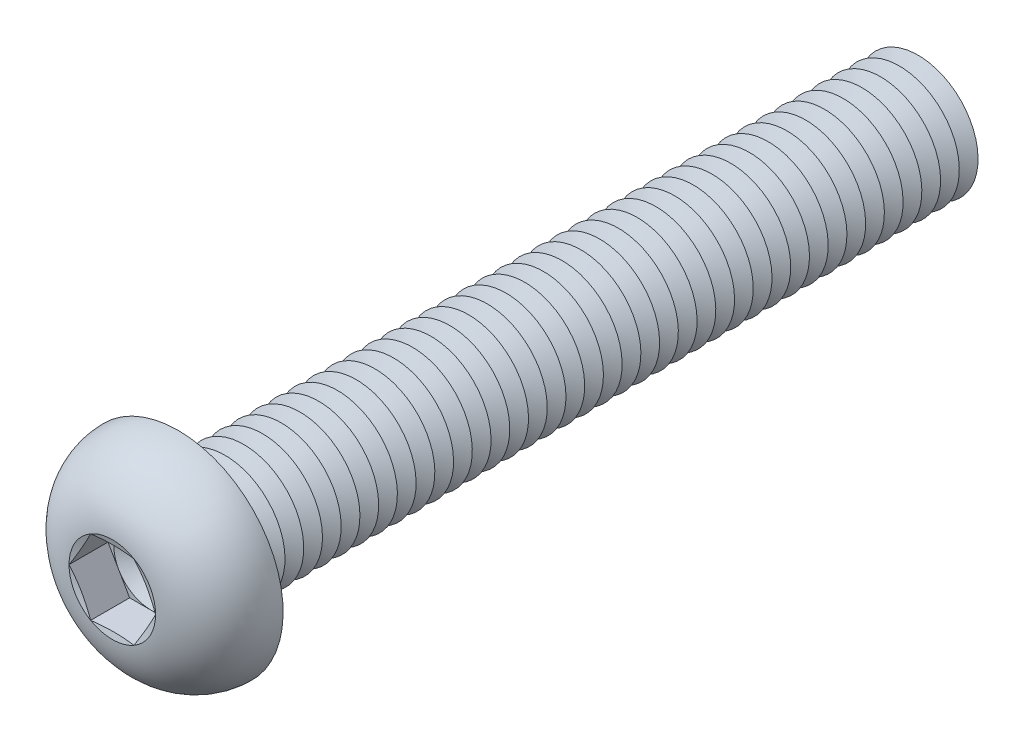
ISO-10303-21;
HEADER;
FILE_DESCRIPTION(('STEP AP214'),'2;1');
FILE_NAME('part.step','',(''),(''),'','','');
FILE_SCHEMA(('AUTOMOTIVE_DESIGN { 1 0 10303 214 1 1 1 1 }'));
ENDSEC;
DATA;
#1=APPLICATION_CONTEXT('core data for automotive mechanical design processes');
#2=APPLICATION_PROTOCOL_DEFINITION('international standard','automotive_design',2000,#1);
#3=PRODUCT_CONTEXT('',#1,'mechanical');
#4=PRODUCT('Part','Part','',(#3));
#5=PRODUCT_RELATED_PRODUCT_CATEGORY('part','',(#4));
#6=PRODUCT_DEFINITION_FORMATION('','',#4);
#7=PRODUCT_DEFINITION_CONTEXT('part definition',#1,'design');
#8=PRODUCT_DEFINITION('design','',#6,#7);
#9=PRODUCT_DEFINITION_SHAPE('','',#8);
#10=(LENGTH_UNIT() NAMED_UNIT(*) SI_UNIT(.MILLI.,.METRE.));
#11=(NAMED_UNIT(*) PLANE_ANGLE_UNIT() SI_UNIT($,.RADIAN.));
#12=(NAMED_UNIT(*) SI_UNIT($,.STERADIAN.) SOLID_ANGLE_UNIT());
#13=UNCERTAINTY_MEASURE_WITH_UNIT(LENGTH_MEASURE(1.E-05),#10,'distance_accuracy_value','');
#14=(GEOMETRIC_REPRESENTATION_CONTEXT(3) GLOBAL_UNCERTAINTY_ASSIGNED_CONTEXT((#13)) GLOBAL_UNIT_ASSIGNED_CONTEXT((#10,
#11,#12)) REPRESENTATION_CONTEXT('',''));
#15=CARTESIAN_POINT('',(0.,0.,0.));
#16=DIRECTION('',(0.,0.,1.));
#17=DIRECTION('',(1.,0.,0.));
#18=AXIS2_PLACEMENT_3D('',#15,#16,#17);
#19=CARTESIAN_POINT('',(0.,0.,1.8));
#20=DIRECTION('',(0.,0.,1.));
#21=DIRECTION('',(1.,0.,0.));
#22=AXIS2_PLACEMENT_3D('',#19,#20,#21);
#23=PLANE('',#22);
#24=CARTESIAN_POINT('',(0.,0.,1.8));
#25=DIRECTION('',(0.,0.,1.));
#26=DIRECTION('',(1.,0.,0.));
#27=AXIS2_PLACEMENT_3D('',#24,#25,#26);
#28=CIRCLE('',#27,2.49999883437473);
#29=CARTESIAN_POINT('',(2.1650625,1.24999941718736,1.8));
#30=VERTEX_POINT('',#29);
#31=CARTESIAN_POINT('',(0.,2.49999883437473,1.8));
#32=VERTEX_POINT('',#31);
#33=EDGE_CURVE('E118',#30,#32,#28,.T.);
#34=ORIENTED_EDGE('',*,*,#33,.F.);
#35=DIRECTION('',(-0.5,0.866025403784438,0.));
#36=VECTOR('',#35,1.);
#37=CARTESIAN_POINT('',(2.88675,0.,1.8));
#38=LINE('',#37,#36);
#39=CARTESIAN_POINT('',(1.443375,2.49999883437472,1.8));
#40=VERTEX_POINT('',#39);
#41=EDGE_CURVE('E125',#30,#40,#38,.T.);
#42=ORIENTED_EDGE('',*,*,#41,.T.);
#43=DIRECTION('',(-1.,0.,0.));
#44=VECTOR('',#43,1.);
#45=CARTESIAN_POINT('',(1.443375,2.49999883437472,1.8));
#46=LINE('',#45,#44);
#47=EDGE_CURVE('E136',#40,#32,#46,.T.);
#48=ORIENTED_EDGE('',*,*,#47,.T.);
#49=EDGE_LOOP('',(#34,#42,#48));
#50=FACE_BOUND('',#49,.T.);
#51=ADVANCED_FACE('F39',(#50),#23,.T.);
#52=CARTESIAN_POINT('',(0.,0.,1.8));
#53=DIRECTION('',(0.,0.,1.));
#54=DIRECTION('',(1.,0.,0.));
#55=AXIS2_PLACEMENT_3D('',#52,#53,#54);
#56=CIRCLE('',#55,2.49999883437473);
#57=CARTESIAN_POINT('',(-2.1650625,1.24999941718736,1.8));
#58=VERTEX_POINT('',#57);
#59=EDGE_CURVE('E11',#32,#58,#56,.T.);
#60=ORIENTED_EDGE('',*,*,#59,.F.);
#61=CARTESIAN_POINT('',(-1.443375,2.49999883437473,1.8));
#62=VERTEX_POINT('',#61);
#63=EDGE_CURVE('E131',#32,#62,#46,.T.);
#64=ORIENTED_EDGE('',*,*,#63,.T.);
#65=DIRECTION('',(-0.5,-0.866025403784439,0.));
#66=VECTOR('',#65,1.);
#67=CARTESIAN_POINT('',(-1.443375,2.49999883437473,1.8));
#68=LINE('',#67,#66);
#69=EDGE_CURVE('E134',#62,#58,#68,.T.);
#70=ORIENTED_EDGE('',*,*,#69,.T.);
#71=EDGE_LOOP('',(#60,#64,#70));
#72=FACE_BOUND('',#71,.T.);
#73=ADVANCED_FACE('F130',(#72),#23,.T.);
#74=CARTESIAN_POINT('',(-2.1650625,-1.24999941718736,1.8));
#75=VERTEX_POINT('',#74);
#76=EDGE_CURVE('E49',#58,#75,#56,.T.);
#77=ORIENTED_EDGE('',*,*,#76,.F.);
#78=CARTESIAN_POINT('',(-2.88675,0.,1.8));
#79=VERTEX_POINT('',#78);
#80=EDGE_CURVE('E143',#58,#79,#68,.T.);
#81=ORIENTED_EDGE('',*,*,#80,.T.);
#82=DIRECTION('',(0.5,-0.866025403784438,0.));
#83=VECTOR('',#82,1.);
#84=CARTESIAN_POINT('',(-2.88675,0.,1.8));
#85=LINE('',#84,#83);
#86=EDGE_CURVE('E152',#79,#75,#85,.T.);
#87=ORIENTED_EDGE('',*,*,#86,.T.);
#88=EDGE_LOOP('',(#77,#81,#87));
#89=FACE_BOUND('',#88,.T.);
#90=ADVANCED_FACE('F590',(#89),#23,.T.);
#91=CARTESIAN_POINT('',(0.,-2.49999883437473,1.8));
#92=VERTEX_POINT('',#91);
#93=EDGE_CURVE('E575',#75,#92,#56,.T.);
#94=ORIENTED_EDGE('',*,*,#93,.F.);
#95=CARTESIAN_POINT('',(-1.443375,-2.49999883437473,1.8));
#96=VERTEX_POINT('',#95);
#97=EDGE_CURVE('E151',#75,#96,#85,.T.);
#98=ORIENTED_EDGE('',*,*,#97,.T.);
#99=DIRECTION('',(1.,0.,0.));
#100=VECTOR('',#99,1.);
#101=CARTESIAN_POINT('',(-1.443375,-2.49999883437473,1.8));
#102=LINE('',#101,#100);
#103=EDGE_CURVE('E157',#96,#92,#102,.T.);
#104=ORIENTED_EDGE('',*,*,#103,.T.);
#105=EDGE_LOOP('',(#94,#98,#104));
#106=FACE_BOUND('',#105,.T.);
#107=ADVANCED_FACE('F583',(#106),#23,.T.);
#108=CARTESIAN_POINT('',(2.1650625,-1.24999941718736,1.8));
#109=VERTEX_POINT('',#108);
#110=EDGE_CURVE('E56',#92,#109,#56,.T.);
#111=ORIENTED_EDGE('',*,*,#110,.F.);
#112=CARTESIAN_POINT('',(1.443375,-2.49999883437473,1.8));
#113=VERTEX_POINT('',#112);
#114=EDGE_CURVE('E156',#92,#113,#102,.T.);
#115=ORIENTED_EDGE('',*,*,#114,.T.);
#116=DIRECTION('',(0.5,0.866025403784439,0.));
#117=VECTOR('',#116,1.);
#118=CARTESIAN_POINT('',(1.443375,-2.49999883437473,1.8));
#119=LINE('',#118,#117);
#120=EDGE_CURVE('E162',#113,#109,#119,.T.);
#121=ORIENTED_EDGE('',*,*,#120,.T.);
#122=EDGE_LOOP('',(#111,#115,#121));
#123=FACE_BOUND('',#122,.T.);
#124=ADVANCED_FACE('F660',(#123),#23,.T.);
#125=CARTESIAN_POINT('',(0.,0.,4.4));
#126=DIRECTION('',(0.,0.,1.));
#127=DIRECTION('',(0.,-1.,0.));
#128=AXIS2_PLACEMENT_3D('',#125,#126,#127);
#129=CONICAL_SURFACE('',#128,2.88675,1.30899693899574);
#130=CARTESIAN_POINT('',(2.88686547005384,-0.000200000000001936,4.40003094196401));
#131=CARTESIAN_POINT('',(2.82691617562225,0.103635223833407,4.3839595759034));
#132=CARTESIAN_POINT('',(2.76685817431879,0.20765873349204,4.36936933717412));
#133=CARTESIAN_POINT('',(2.64653003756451,0.416073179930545,4.3437355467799));
#134=CARTESIAN_POINT('',(2.58625982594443,0.520464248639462,4.33269343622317));
#135=CARTESIAN_POINT('',(2.46587274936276,0.72898078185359,4.31480063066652));
#136=CARTESIAN_POINT('',(2.40575669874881,0.833104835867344,4.3079285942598));
#137=CARTESIAN_POINT('',(2.28544792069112,1.04148575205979,4.29871388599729));
#138=CARTESIAN_POINT('',(2.22525521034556,1.14574258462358,4.29637033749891));
#139=CARTESIAN_POINT('',(2.10486978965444,1.35425624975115,4.29637033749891));
#140=CARTESIAN_POINT('',(2.04467707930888,1.45851308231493,4.29871388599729));
#141=CARTESIAN_POINT('',(1.92436830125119,1.66689399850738,4.3079285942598));
#142=CARTESIAN_POINT('',(1.86425225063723,1.77101805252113,4.31480063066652));
#143=CARTESIAN_POINT('',(1.74386517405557,1.97953458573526,4.33269343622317));
#144=CARTESIAN_POINT('',(1.68359496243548,2.08392565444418,4.3437355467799));
#145=CARTESIAN_POINT('',(1.56326682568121,2.29234010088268,4.36936933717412));
#146=CARTESIAN_POINT('',(1.50320882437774,2.39636361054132,4.3839595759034));
#147=CARTESIAN_POINT('',(1.44325952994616,2.50019883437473,4.40003094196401));
#148=B_SPLINE_CURVE_WITH_KNOTS('',3,(#130,#131,#132,#133,#134,#135,#136,#137,#138,#139,#140,
#141,#142,#143,#144,#145,#146,#147),.UNSPECIFIED.,.F.,.F.,(4,2,2,2,2,2,2,2,4),(0.,
0.362931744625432,0.726010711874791,1.08721550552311,1.44835036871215,1.80948523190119,
2.17069002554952,2.53376899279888,2.89670073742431),.UNSPECIFIED.);
#149=CARTESIAN_POINT('',(2.88675,0.,4.4));
#150=VERTEX_POINT('',#149);
#151=CARTESIAN_POINT('',(1.443375,2.49999883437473,4.4));
#152=VERTEX_POINT('',#151);
#153=EDGE_CURVE('E221',#150,#152,#148,.T.);
#154=ORIENTED_EDGE('',*,*,#153,.F.);
#155=CARTESIAN_POINT('',(0.,0.,4.4));
#156=DIRECTION('',(0.,0.,-1.));
#157=DIRECTION('',(0.,1.,0.));
#158=AXIS2_PLACEMENT_3D('',#155,#156,#157);
#159=CIRCLE('',#158,2.88675);
#160=EDGE_CURVE('E557',#152,#150,#159,.T.);
#161=ORIENTED_EDGE('',*,*,#160,.F.);
#162=EDGE_LOOP('',(#154,#161));
#163=FACE_BOUND('',#162,.T.);
#164=ADVANCED_FACE('F664',(#163),#129,.F.);
#165=CARTESIAN_POINT('',(1.44325952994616,-2.50019883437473,4.40003094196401));
#166=CARTESIAN_POINT('',(1.50320882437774,-2.39636361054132,4.3839595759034));
#167=CARTESIAN_POINT('',(1.56326682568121,-2.29234010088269,4.36936933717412));
#168=CARTESIAN_POINT('',(1.68359496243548,-2.08392565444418,4.3437355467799));
#169=CARTESIAN_POINT('',(1.74386517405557,-1.97953458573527,4.33269343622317));
#170=CARTESIAN_POINT('',(1.86425225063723,-1.77101805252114,4.31480063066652));
#171=CARTESIAN_POINT('',(1.92436830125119,-1.66689399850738,4.3079285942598));
#172=CARTESIAN_POINT('',(2.04467707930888,-1.45851308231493,4.29871388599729));
#173=CARTESIAN_POINT('',(2.10486978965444,-1.35425624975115,4.29637033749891));
#174=CARTESIAN_POINT('',(2.22525521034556,-1.14574258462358,4.29637033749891));
#175=CARTESIAN_POINT('',(2.28544792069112,-1.0414857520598,4.29871388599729));
#176=CARTESIAN_POINT('',(2.40575669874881,-0.833104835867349,4.3079285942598));
#177=CARTESIAN_POINT('',(2.46587274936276,-0.728980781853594,4.31480063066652));
#178=CARTESIAN_POINT('',(2.58625982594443,-0.520464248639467,4.33269343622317));
#179=CARTESIAN_POINT('',(2.64653003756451,-0.41607317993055,4.3437355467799));
#180=CARTESIAN_POINT('',(2.76685817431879,-0.207658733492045,4.36936933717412));
#181=CARTESIAN_POINT('',(2.82691617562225,-0.103635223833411,4.3839595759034));
#182=CARTESIAN_POINT('',(2.88686547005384,0.000199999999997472,4.40003094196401));
#183=B_SPLINE_CURVE_WITH_KNOTS('',3,(#165,#166,#167,#168,#169,#170,#171,#172,#173,#174,#175,
#176,#177,#178,#179,#180,#181,#182),.UNSPECIFIED.,.F.,.F.,(4,2,2,2,2,2,2,2,4),(0.,
0.362931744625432,0.726010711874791,1.08721550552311,1.44835036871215,1.80948523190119,
2.17069002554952,2.53376899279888,2.89670073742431),.UNSPECIFIED.);
#184=CARTESIAN_POINT('',(1.443375,-2.49999883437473,4.4));
#185=VERTEX_POINT('',#184);
#186=EDGE_CURVE('E230',#185,#150,#183,.T.);
#187=ORIENTED_EDGE('',*,*,#186,.F.);
#188=EDGE_CURVE('E562',#150,#185,#159,.T.);
#189=ORIENTED_EDGE('',*,*,#188,.F.);
#190=EDGE_LOOP('',(#187,#189));
#191=FACE_BOUND('',#190,.T.);
#192=ADVANCED_FACE('F625',(#191),#129,.F.);
#193=CARTESIAN_POINT('',(-4.35611719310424,-2.49999883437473,4.97227902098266));
#194=CARTESIAN_POINT('',(-4.25066509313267,-2.49999883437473,4.94777440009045));
#195=CARTESIAN_POINT('',(-4.14516541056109,-2.49999883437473,4.92347459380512));
#196=CARTESIAN_POINT('',(-3.93405094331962,-2.49999883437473,4.87537247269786));
#197=CARTESIAN_POINT('',(-3.82843615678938,-2.49999883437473,4.85157016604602));
#198=CARTESIAN_POINT('',(-3.5113534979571,-2.49999883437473,4.78103338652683));
#199=CARTESIAN_POINT('',(-3.29968815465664,-2.49999883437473,4.73517861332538));
#200=CARTESIAN_POINT('',(-2.87365524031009,-2.49999883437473,4.64645582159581));
#201=CARTESIAN_POINT('',(-2.65928093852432,-2.49999883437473,4.60361983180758));
#202=CARTESIAN_POINT('',(-2.22952626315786,-2.49999883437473,4.52311285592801));
#203=CARTESIAN_POINT('',(-2.01414580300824,-2.49999883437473,4.48544232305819));
#204=CARTESIAN_POINT('',(-1.58798319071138,-2.49999883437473,4.41876559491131));
#205=CARTESIAN_POINT('',(-1.37723418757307,-2.49999883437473,4.38955265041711));
#206=CARTESIAN_POINT('',(-0.954530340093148,-2.49999883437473,4.34171384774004));
#207=CARTESIAN_POINT('',(-0.742575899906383,-2.49999883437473,4.32308463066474));
#208=CARTESIAN_POINT('',(-0.424544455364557,-2.49999883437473,4.30539140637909));
#209=CARTESIAN_POINT('',(-0.318745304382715,-2.49999883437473,4.30120018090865));
#210=CARTESIAN_POINT('',(-0.107062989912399,-2.49999883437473,4.29638997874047));
#211=CARTESIAN_POINT('',(-0.00117982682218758,-2.49999883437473,4.29577098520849));
#212=CARTESIAN_POINT('',(0.210552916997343,-2.49999883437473,4.29814378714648));
#213=CARTESIAN_POINT('',(0.316402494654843,-2.49999883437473,4.30113585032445));
#214=CARTESIAN_POINT('',(0.527944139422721,-2.49999883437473,4.31057322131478));
#215=CARTESIAN_POINT('',(0.633636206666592,-2.49999883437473,4.31701852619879));
#216=CARTESIAN_POINT('',(0.890304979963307,-2.49999883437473,4.33652018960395));
#217=CARTESIAN_POINT('',(1.0411561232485,-2.49999883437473,4.35122885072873));
#218=CARTESIAN_POINT('',(1.34222474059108,-2.49999883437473,4.38593609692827));
#219=CARTESIAN_POINT('',(1.49244223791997,-2.49999883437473,4.40593448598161));
#220=CARTESIAN_POINT('',(1.79273634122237,-2.49999883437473,4.45011321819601));
#221=CARTESIAN_POINT('',(1.94281100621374,-2.49999883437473,4.47430656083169));
#222=CARTESIAN_POINT('',(2.24242097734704,-2.49999883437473,4.52583552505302));
#223=CARTESIAN_POINT('',(2.39195625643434,-2.49999883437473,4.55317130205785));
#224=CARTESIAN_POINT('',(2.69364402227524,-2.49999883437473,4.61079781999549));
#225=CARTESIAN_POINT('',(2.8457870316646,-2.49999883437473,4.64113779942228));
#226=CARTESIAN_POINT('',(3.14969016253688,-2.49999883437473,4.70367638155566));
#227=CARTESIAN_POINT('',(3.30145027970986,-2.49999883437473,4.73587500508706));
#228=CARTESIAN_POINT('',(3.60383766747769,-2.49999883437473,4.80150275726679));
#229=CARTESIAN_POINT('',(3.75446660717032,-2.49999883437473,4.83492423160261));
#230=CARTESIAN_POINT('',(4.05546753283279,-2.49999883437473,4.90285814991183));
#231=CARTESIAN_POINT('',(4.2058395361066,-2.49999883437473,4.9373705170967));
#232=CARTESIAN_POINT('',(4.35611719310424,-2.49999883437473,4.97227902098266));
#233=B_SPLINE_CURVE_WITH_KNOTS('',3,(#193,#194,#195,#196,#197,#198,#199,#200,#201,#202,#203,
#204,#205,#206,#207,#208,#209,#210,#211,#212,#213,#214,#215,#216,#217,#218,#219,#220,#221,#222,
#223,#224,#225,#226,#227,#228,#229,#230,#231,#232),.UNSPECIFIED.,.F.,.F.,(4,2,2,2,2,2,2,2,2,2,2,
2,2,2,2,2,2,2,2,4),(0.,0.324785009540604,0.6495753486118,1.29928181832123,1.95507889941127,
2.61093348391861,3.24905289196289,3.88696967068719,4.204563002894,4.5221548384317,
4.83977022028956,5.15738533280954,5.61196030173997,6.06651842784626,6.52251118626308,
6.97852650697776,7.44392737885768,7.90933346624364,8.37220553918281,8.83504510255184),.UNSPECIFIED.);
#234=CARTESIAN_POINT('',(-1.443375,-2.49999883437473,4.4));
#235=VERTEX_POINT('',#234);
#236=EDGE_CURVE('E604',#235,#185,#233,.T.);
#237=ORIENTED_EDGE('',*,*,#236,.F.);
#238=EDGE_CURVE('E616',#185,#235,#159,.T.);
#239=ORIENTED_EDGE('',*,*,#238,.F.);
#240=EDGE_LOOP('',(#237,#239));
#241=FACE_BOUND('',#240,.T.);
#242=ADVANCED_FACE('F631',(#241),#129,.F.);
#243=CARTESIAN_POINT('',(-2.88686547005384,0.000199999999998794,4.40003094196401));
#244=CARTESIAN_POINT('',(-2.82691617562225,-0.10363522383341,4.3839595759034));
#245=CARTESIAN_POINT('',(-2.76685817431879,-0.207658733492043,4.36936933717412));
#246=CARTESIAN_POINT('',(-2.64653003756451,-0.416073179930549,4.3437355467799));
#247=CARTESIAN_POINT('',(-2.58625982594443,-0.520464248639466,4.33269343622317));
#248=CARTESIAN_POINT('',(-2.46587274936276,-0.728980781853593,4.31480063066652));
#249=CARTESIAN_POINT('',(-2.40575669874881,-0.833104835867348,4.3079285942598));
#250=CARTESIAN_POINT('',(-2.28544792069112,-1.0414857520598,4.29871388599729));
#251=CARTESIAN_POINT('',(-2.22525521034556,-1.14574258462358,4.29637033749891));
#252=CARTESIAN_POINT('',(-2.10486978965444,-1.35425624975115,4.29637033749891));
#253=CARTESIAN_POINT('',(-2.04467707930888,-1.45851308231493,4.29871388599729));
#254=CARTESIAN_POINT('',(-1.92436830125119,-1.66689399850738,4.3079285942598));
#255=CARTESIAN_POINT('',(-1.86425225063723,-1.77101805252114,4.31480063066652));
#256=CARTESIAN_POINT('',(-1.74386517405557,-1.97953458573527,4.33269343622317));
#257=CARTESIAN_POINT('',(-1.68359496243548,-2.08392565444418,4.3437355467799));
#258=CARTESIAN_POINT('',(-1.56326682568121,-2.29234010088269,4.36936933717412));
#259=CARTESIAN_POINT('',(-1.50320882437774,-2.39636361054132,4.3839595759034));
#260=CARTESIAN_POINT('',(-1.44325952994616,-2.50019883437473,4.40003094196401));
#261=B_SPLINE_CURVE_WITH_KNOTS('',3,(#243,#244,#245,#246,#247,#248,#249,#250,#251,#252,#253,
#254,#255,#256,#257,#258,#259,#260),.UNSPECIFIED.,.F.,.F.,(4,2,2,2,2,2,2,2,4),(0.,
0.362931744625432,0.726010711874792,1.08721550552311,1.44835036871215,1.80948523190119,
2.17069002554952,2.53376899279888,2.89670073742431),.UNSPECIFIED.);
#262=CARTESIAN_POINT('',(-2.88675,0.,4.4));
#263=VERTEX_POINT('',#262);
#264=EDGE_CURVE('E595',#263,#235,#261,.T.);
#265=ORIENTED_EDGE('',*,*,#264,.F.);
#266=EDGE_CURVE('E601',#235,#263,#159,.T.);
#267=ORIENTED_EDGE('',*,*,#266,.F.);
#268=EDGE_LOOP('',(#265,#267));
#269=FACE_BOUND('',#268,.T.);
#270=ADVANCED_FACE('F599',(#269),#129,.F.);
#271=CARTESIAN_POINT('',(-1.44325952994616,2.50019883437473,4.40003094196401));
#272=CARTESIAN_POINT('',(-1.50320882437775,2.39636361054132,4.3839595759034));
#273=CARTESIAN_POINT('',(-1.56326682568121,2.29234010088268,4.36936933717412));
#274=CARTESIAN_POINT('',(-1.68359496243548,2.08392565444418,4.3437355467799));
#275=CARTESIAN_POINT('',(-1.74386517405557,1.97953458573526,4.33269343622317));
#276=CARTESIAN_POINT('',(-1.86425225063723,1.77101805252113,4.31480063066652));
#277=CARTESIAN_POINT('',(-1.92436830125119,1.66689399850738,4.3079285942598));
#278=CARTESIAN_POINT('',(-2.04467707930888,1.45851308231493,4.29871388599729));
#279=CARTESIAN_POINT('',(-2.10486978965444,1.35425624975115,4.29637033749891));
#280=CARTESIAN_POINT('',(-2.22525521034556,1.14574258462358,4.29637033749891));
#281=CARTESIAN_POINT('',(-2.28544792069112,1.04148575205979,4.29871388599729));
#282=CARTESIAN_POINT('',(-2.40575669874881,0.833104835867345,4.3079285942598));
#283=CARTESIAN_POINT('',(-2.46587274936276,0.728980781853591,4.31480063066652));
#284=CARTESIAN_POINT('',(-2.58625982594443,0.520464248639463,4.33269343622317));
#285=CARTESIAN_POINT('',(-2.64653003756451,0.416073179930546,4.3437355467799));
#286=CARTESIAN_POINT('',(-2.76685817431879,0.207658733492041,4.36936933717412));
#287=CARTESIAN_POINT('',(-2.82691617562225,0.103635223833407,4.3839595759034));
#288=CARTESIAN_POINT('',(-2.88686547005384,-0.000200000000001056,4.40003094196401));
#289=B_SPLINE_CURVE_WITH_KNOTS('',3,(#271,#272,#273,#274,#275,#276,#277,#278,#279,#280,#281,
#282,#283,#284,#285,#286,#287,#288),.UNSPECIFIED.,.F.,.F.,(4,2,2,2,2,2,2,2,4),(0.,
0.362931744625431,0.72601071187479,1.08721550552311,1.44835036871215,1.80948523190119,
2.17069002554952,2.53376899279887,2.89670073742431),.UNSPECIFIED.);
#290=CARTESIAN_POINT('',(-1.443375,2.49999883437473,4.4));
#291=VERTEX_POINT('',#290);
#292=EDGE_CURVE('E195',#291,#263,#289,.T.);
#293=ORIENTED_EDGE('',*,*,#292,.F.);
#294=EDGE_CURVE('E607',#263,#291,#159,.T.);
#295=ORIENTED_EDGE('',*,*,#294,.F.);
#296=EDGE_LOOP('',(#293,#295));
#297=FACE_BOUND('',#296,.T.);
#298=ADVANCED_FACE('F608',(#297),#129,.F.);
#299=CARTESIAN_POINT('',(0.,0.,-45.625));
#300=DIRECTION('',(0.,0.,1.));
#301=DIRECTION('',(0.,-1.,0.));
#302=AXIS2_PLACEMENT_3D('',#299,#300,#301);
#303=CONICAL_SURFACE('',#302,3.99999999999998,1.0471975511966);
#304=CARTESIAN_POINT('',(0.,0.,-46.25));
#305=DIRECTION('',(0.,0.,1.));
#306=DIRECTION('',(0.,-1.,0.));
#307=AXIS2_PLACEMENT_3D('',#304,#305,#306);
#308=CIRCLE('',#307,2.91746824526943);
#309=CARTESIAN_POINT('',(0.,-2.91746824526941,-46.25));
#310=VERTEX_POINT('',#309);
#311=EDGE_CURVE('E528',#310,#310,#308,.T.);
#312=ORIENTED_EDGE('',*,*,#311,.T.);
#313=EDGE_LOOP('',(#312));
#314=FACE_BOUND('',#313,.T.);
#315=CARTESIAN_POINT('',(0.,0.,-45.625));
#316=DIRECTION('',(0.,0.,1.));
#317=DIRECTION('',(0.,-1.,0.));
#318=AXIS2_PLACEMENT_3D('',#315,#316,#317);
#319=CIRCLE('',#318,3.99999999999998);
#320=CARTESIAN_POINT('',(0.,-3.99999999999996,-45.625));
#321=VERTEX_POINT('',#320);
#322=EDGE_CURVE('E524',#321,#321,#319,.T.);
#323=ORIENTED_EDGE('',*,*,#322,.F.);
#324=EDGE_LOOP('',(#323));
#325=FACE_BOUND('',#324,.T.);
#326=ADVANCED_FACE('F686',(#314,#325),#303,.T.);
#327=CARTESIAN_POINT('',(0.,0.,-46.25));
#328=DIRECTION('',(0.,0.,-1.));
#329=DIRECTION('',(0.,1.,0.));
#330=AXIS2_PLACEMENT_3D('',#327,#328,#329);
#331=CONICAL_SURFACE('',#330,2.91746824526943,1.0471975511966);
#332=CARTESIAN_POINT('',(0.,0.,-46.875));
#333=DIRECTION('',(0.,0.,1.));
#334=DIRECTION('',(0.,-1.,0.));
#335=AXIS2_PLACEMENT_3D('',#332,#333,#334);
#336=CIRCLE('',#335,3.99999999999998);
#337=CARTESIAN_POINT('',(0.,-3.99999999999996,-46.875));
#338=VERTEX_POINT('',#337);
#339=EDGE_CURVE('E532',#338,#338,#336,.T.);
#340=ORIENTED_EDGE('',*,*,#339,.T.);
#341=EDGE_LOOP('',(#340));
#342=FACE_BOUND('',#341,.T.);
#343=ORIENTED_EDGE('',*,*,#311,.F.);
#344=EDGE_LOOP('',(#343));
#345=FACE_BOUND('',#344,.T.);
#346=ADVANCED_FACE('F691',(#342,#345),#331,.T.);
#347=CARTESIAN_POINT('',(0.,3.99999999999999,-50.));
#348=DIRECTION('',(0.,0.,-1.));
#349=DIRECTION('',(0.,1.,0.));
#350=AXIS2_PLACEMENT_3D('',#347,#348,#349);
#351=PLANE('',#350);
#352=CARTESIAN_POINT('',(0.,0.,-50.));
#353=DIRECTION('',(0.,0.,1.));
#354=DIRECTION('',(0.,-1.,0.));
#355=AXIS2_PLACEMENT_3D('',#352,#353,#354);
#356=CIRCLE('',#355,2.91746824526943);
#357=CARTESIAN_POINT('',(0.,-2.91746824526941,-50.));
#358=VERTEX_POINT('',#357);
#359=EDGE_CURVE('E552',#358,#358,#356,.T.);
#360=ORIENTED_EDGE('',*,*,#359,.F.);
#361=EDGE_LOOP('',(#360));
#362=FACE_BOUND('',#361,.T.);
#363=ADVANCED_FACE('F858',(#362),#351,.T.);
#364=CARTESIAN_POINT('',(0.,0.,-49.375));
#365=DIRECTION('',(0.,0.,1.));
#366=DIRECTION('',(0.,-1.,0.));
#367=AXIS2_PLACEMENT_3D('',#364,#365,#366);
#368=CONICAL_SURFACE('',#367,3.99999999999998,1.0471975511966);
#369=ORIENTED_EDGE('',*,*,#359,.T.);
#370=EDGE_LOOP('',(#369));
#371=FACE_BOUND('',#370,.T.);
#372=CARTESIAN_POINT('',(0.,0.,-49.375));
#373=DIRECTION('',(0.,0.,1.));
#374=DIRECTION('',(0.,-1.,0.));
#375=AXIS2_PLACEMENT_3D('',#372,#373,#374);
#376=CIRCLE('',#375,3.99999999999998);
#377=CARTESIAN_POINT('',(0.,-3.99999999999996,-49.375));
#378=VERTEX_POINT('',#377);
#379=EDGE_CURVE('E548',#378,#378,#376,.T.);
#380=ORIENTED_EDGE('',*,*,#379,.F.);
#381=EDGE_LOOP('',(#380));
#382=FACE_BOUND('',#381,.T.);
#383=ADVANCED_FACE('F851',(#371,#382),#368,.T.);
#384=CARTESIAN_POINT('',(0.,0.,-48.75));
#385=DIRECTION('',(0.,0.,-1.));
#386=DIRECTION('',(0.,1.,0.));
#387=AXIS2_PLACEMENT_3D('',#384,#385,#386);
#388=CONICAL_SURFACE('',#387,2.91746824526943,1.0471975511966);
#389=ORIENTED_EDGE('',*,*,#379,.T.);
#390=EDGE_LOOP('',(#389));
#391=FACE_BOUND('',#390,.T.);
#392=CARTESIAN_POINT('',(0.,0.,-48.75));
#393=DIRECTION('',(0.,0.,1.));
#394=DIRECTION('',(0.,-1.,0.));
#395=AXIS2_PLACEMENT_3D('',#392,#393,#394);
#396=CIRCLE('',#395,2.91746824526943);
#397=CARTESIAN_POINT('',(0.,-2.91746824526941,-48.75));
#398=VERTEX_POINT('',#397);
#399=EDGE_CURVE('E544',#398,#398,#396,.T.);
#400=ORIENTED_EDGE('',*,*,#399,.F.);
#401=EDGE_LOOP('',(#400));
#402=FACE_BOUND('',#401,.T.);
#403=ADVANCED_FACE('F857',(#391,#402),#388,.T.);
#404=CARTESIAN_POINT('',(0.,0.,-48.125));
#405=DIRECTION('',(0.,0.,1.));
#406=DIRECTION('',(0.,-1.,0.));
#407=AXIS2_PLACEMENT_3D('',#404,#405,#406);
#408=CONICAL_SURFACE('',#407,3.99999999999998,1.0471975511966);
#409=ORIENTED_EDGE('',*,*,#399,.T.);
#410=EDGE_LOOP('',(#409));
#411=FACE_BOUND('',#410,.T.);
#412=CARTESIAN_POINT('',(0.,0.,-48.125));
#413=DIRECTION('',(0.,0.,1.));
#414=DIRECTION('',(0.,-1.,0.));
#415=AXIS2_PLACEMENT_3D('',#412,#413,#414);
#416=CIRCLE('',#415,3.99999999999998);
#417=CARTESIAN_POINT('',(0.,-3.99999999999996,-48.125));
#418=VERTEX_POINT('',#417);
#419=EDGE_CURVE('E540',#418,#418,#416,.T.);
#420=ORIENTED_EDGE('',*,*,#419,.F.);
#421=EDGE_LOOP('',(#420));
#422=FACE_BOUND('',#421,.T.);
#423=ADVANCED_FACE('F889',(#411,#422),#408,.T.);
#424=CARTESIAN_POINT('',(0.,0.,-47.5));
#425=DIRECTION('',(0.,0.,-1.));
#426=DIRECTION('',(0.,1.,0.));
#427=AXIS2_PLACEMENT_3D('',#424,#425,#426);
#428=CONICAL_SURFACE('',#427,2.91746824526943,1.0471975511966);
#429=ORIENTED_EDGE('',*,*,#419,.T.);
#430=EDGE_LOOP('',(#429));
#431=FACE_BOUND('',#430,.T.);
#432=CARTESIAN_POINT('',(0.,0.,-47.5));
#433=DIRECTION('',(0.,0.,1.));
#434=DIRECTION('',(0.,-1.,0.));
#435=AXIS2_PLACEMENT_3D('',#432,#433,#434);
#436=CIRCLE('',#435,2.91746824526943);
#437=CARTESIAN_POINT('',(0.,-2.91746824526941,-47.5));
#438=VERTEX_POINT('',#437);
#439=EDGE_CURVE('E536',#438,#438,#436,.T.);
#440=ORIENTED_EDGE('',*,*,#439,.F.);
#441=EDGE_LOOP('',(#440));
#442=FACE_BOUND('',#441,.T.);
#443=ADVANCED_FACE('F899',(#431,#442),#428,.T.);
#444=CARTESIAN_POINT('',(0.,0.,-46.875));
#445=DIRECTION('',(0.,0.,1.));
#446=DIRECTION('',(0.,-1.,0.));
#447=AXIS2_PLACEMENT_3D('',#444,#445,#446);
#448=CONICAL_SURFACE('',#447,3.99999999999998,1.0471975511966);
#449=ORIENTED_EDGE('',*,*,#439,.T.);
#450=EDGE_LOOP('',(#449));
#451=FACE_BOUND('',#450,.T.);
#452=ORIENTED_EDGE('',*,*,#339,.F.);
#453=EDGE_LOOP('',(#452));
#454=FACE_BOUND('',#453,.T.);
#455=ADVANCED_FACE('F909',(#451,#454),#448,.T.);
#456=CARTESIAN_POINT('',(0.,0.,-44.375));
#457=DIRECTION('',(0.,0.,1.));
#458=DIRECTION('',(0.,-1.,0.));
#459=AXIS2_PLACEMENT_3D('',#456,#457,#458);
#460=CONICAL_SURFACE('',#459,3.99999999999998,1.0471975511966);
#461=CARTESIAN_POINT('',(0.,0.,-45.));
#462=DIRECTION('',(0.,0.,1.));
#463=DIRECTION('',(0.,-1.,0.));
#464=AXIS2_PLACEMENT_3D('',#461,#462,#463);
#465=CIRCLE('',#464,2.91746824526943);
#466=CARTESIAN_POINT('',(0.,-2.91746824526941,-45.));
#467=VERTEX_POINT('',#466);
#468=EDGE_CURVE('E520',#467,#467,#465,.T.);
#469=ORIENTED_EDGE('',*,*,#468,.T.);
#470=EDGE_LOOP('',(#469));
#471=FACE_BOUND('',#470,.T.);
#472=CARTESIAN_POINT('',(0.,0.,-44.375));
#473=DIRECTION('',(0.,0.,1.));
#474=DIRECTION('',(0.,-1.,0.));
#475=AXIS2_PLACEMENT_3D('',#472,#473,#474);
#476=CIRCLE('',#475,3.99999999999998);
#477=CARTESIAN_POINT('',(0.,-3.99999999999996,-44.375));
#478=VERTEX_POINT('',#477);
#479=EDGE_CURVE('E516',#478,#478,#476,.T.);
#480=ORIENTED_EDGE('',*,*,#479,.F.);
#481=EDGE_LOOP('',(#480));
#482=FACE_BOUND('',#481,.T.);
#483=ADVANCED_FACE('F919',(#471,#482),#460,.T.);
#484=CARTESIAN_POINT('',(0.,0.,-45.));
#485=DIRECTION('',(0.,0.,-1.));
#486=DIRECTION('',(0.,1.,0.));
#487=AXIS2_PLACEMENT_3D('',#484,#485,#486);
#488=CONICAL_SURFACE('',#487,2.91746824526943,1.0471975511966);
#489=ORIENTED_EDGE('',*,*,#322,.T.);
#490=EDGE_LOOP('',(#489));
#491=FACE_BOUND('',#490,.T.);
#492=ORIENTED_EDGE('',*,*,#468,.F.);
#493=EDGE_LOOP('',(#492));
#494=FACE_BOUND('',#493,.T.);
#495=ADVANCED_FACE('F929',(#491,#494),#488,.T.);
#496=CARTESIAN_POINT('',(0.,0.,-43.125));
#497=DIRECTION('',(0.,0.,1.));
#498=DIRECTION('',(0.,-1.,0.));
#499=AXIS2_PLACEMENT_3D('',#496,#497,#498);
#500=CONICAL_SURFACE('',#499,3.99999999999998,1.0471975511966);
#501=CARTESIAN_POINT('',(0.,0.,-43.75));
#502=DIRECTION('',(0.,0.,1.));
#503=DIRECTION('',(0.,-1.,0.));
#504=AXIS2_PLACEMENT_3D('',#501,#502,#503);
#505=CIRCLE('',#504,2.91746824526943);
#506=CARTESIAN_POINT('',(0.,-2.91746824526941,-43.75));
#507=VERTEX_POINT('',#506);
#508=EDGE_CURVE('E512',#507,#507,#505,.T.);
#509=ORIENTED_EDGE('',*,*,#508,.T.);
#510=EDGE_LOOP('',(#509));
#511=FACE_BOUND('',#510,.T.);
#512=CARTESIAN_POINT('',(0.,0.,-43.125));
#513=DIRECTION('',(0.,0.,1.));
#514=DIRECTION('',(0.,-1.,0.));
#515=AXIS2_PLACEMENT_3D('',#512,#513,#514);
#516=CIRCLE('',#515,3.99999999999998);
#517=CARTESIAN_POINT('',(0.,-3.99999999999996,-43.125));
#518=VERTEX_POINT('',#517);
#519=EDGE_CURVE('E508',#518,#518,#516,.T.);
#520=ORIENTED_EDGE('',*,*,#519,.F.);
#521=EDGE_LOOP('',(#520));
#522=FACE_BOUND('',#521,.T.);
#523=ADVANCED_FACE('F939',(#511,#522),#500,.T.);
#524=CARTESIAN_POINT('',(0.,0.,-43.75));
#525=DIRECTION('',(0.,0.,-1.));
#526=DIRECTION('',(0.,1.,0.));
#527=AXIS2_PLACEMENT_3D('',#524,#525,#526);
#528=CONICAL_SURFACE('',#527,2.91746824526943,1.0471975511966);
#529=ORIENTED_EDGE('',*,*,#479,.T.);
#530=EDGE_LOOP('',(#529));
#531=FACE_BOUND('',#530,.T.);
#532=ORIENTED_EDGE('',*,*,#508,.F.);
#533=EDGE_LOOP('',(#532));
#534=FACE_BOUND('',#533,.T.);
#535=ADVANCED_FACE('F949',(#531,#534),#528,.T.);
#536=CARTESIAN_POINT('',(0.,0.,-41.875));
#537=DIRECTION('',(0.,0.,1.));
#538=DIRECTION('',(0.,-1.,0.));
#539=AXIS2_PLACEMENT_3D('',#536,#537,#538);
#540=CONICAL_SURFACE('',#539,3.99999999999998,1.0471975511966);
#541=CARTESIAN_POINT('',(0.,0.,-42.5));
#542=DIRECTION('',(0.,0.,1.));
#543=DIRECTION('',(0.,-1.,0.));
#544=AXIS2_PLACEMENT_3D('',#541,#542,#543);
#545=CIRCLE('',#544,2.91746824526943);
#546=CARTESIAN_POINT('',(0.,-2.91746824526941,-42.5));
#547=VERTEX_POINT('',#546);
#548=EDGE_CURVE('E504',#547,#547,#545,.T.);
#549=ORIENTED_EDGE('',*,*,#548,.T.);
#550=EDGE_LOOP('',(#549));
#551=FACE_BOUND('',#550,.T.);
#552=CARTESIAN_POINT('',(0.,0.,-41.875));
#553=DIRECTION('',(0.,0.,1.));
#554=DIRECTION('',(0.,-1.,0.));
#555=AXIS2_PLACEMENT_3D('',#552,#553,#554);
#556=CIRCLE('',#555,3.99999999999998);
#557=CARTESIAN_POINT('',(0.,-3.99999999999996,-41.875));
#558=VERTEX_POINT('',#557);
#559=EDGE_CURVE('E500',#558,#558,#556,.T.);
#560=ORIENTED_EDGE('',*,*,#559,.F.);
#561=EDGE_LOOP('',(#560));
#562=FACE_BOUND('',#561,.T.);
#563=ADVANCED_FACE('F959',(#551,#562),#540,.T.);
#564=CARTESIAN_POINT('',(0.,0.,-42.5));
#565=DIRECTION('',(0.,0.,-1.));
#566=DIRECTION('',(0.,1.,0.));
#567=AXIS2_PLACEMENT_3D('',#564,#565,#566);
#568=CONICAL_SURFACE('',#567,2.91746824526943,1.0471975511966);
#569=ORIENTED_EDGE('',*,*,#519,.T.);
#570=EDGE_LOOP('',(#569));
#571=FACE_BOUND('',#570,.T.);
#572=ORIENTED_EDGE('',*,*,#548,.F.);
#573=EDGE_LOOP('',(#572));
#574=FACE_BOUND('',#573,.T.);
#575=ADVANCED_FACE('F969',(#571,#574),#568,.T.);
#576=CARTESIAN_POINT('',(0.,0.,-40.625));
#577=DIRECTION('',(0.,0.,1.));
#578=DIRECTION('',(0.,-1.,0.));
#579=AXIS2_PLACEMENT_3D('',#576,#577,#578);
#580=CONICAL_SURFACE('',#579,3.99999999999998,1.0471975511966);
#581=CARTESIAN_POINT('',(0.,0.,-41.25));
#582=DIRECTION('',(0.,0.,1.));
#583=DIRECTION('',(0.,-1.,0.));
#584=AXIS2_PLACEMENT_3D('',#581,#582,#583);
#585=CIRCLE('',#584,2.91746824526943);
#586=CARTESIAN_POINT('',(0.,-2.91746824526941,-41.25));
#587=VERTEX_POINT('',#586);
#588=EDGE_CURVE('E496',#587,#587,#585,.T.);
#589=ORIENTED_EDGE('',*,*,#588,.T.);
#590=EDGE_LOOP('',(#589));
#591=FACE_BOUND('',#590,.T.);
#592=CARTESIAN_POINT('',(0.,0.,-40.625));
#593=DIRECTION('',(0.,0.,1.));
#594=DIRECTION('',(0.,-1.,0.));
#595=AXIS2_PLACEMENT_3D('',#592,#593,#594);
#596=CIRCLE('',#595,3.99999999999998);
#597=CARTESIAN_POINT('',(0.,-3.99999999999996,-40.625));
#598=VERTEX_POINT('',#597);
#599=EDGE_CURVE('E492',#598,#598,#596,.T.);
#600=ORIENTED_EDGE('',*,*,#599,.F.);
#601=EDGE_LOOP('',(#600));
#602=FACE_BOUND('',#601,.T.);
#603=ADVANCED_FACE('F979',(#591,#602),#580,.T.);
#604=CARTESIAN_POINT('',(0.,0.,-41.25));
#605=DIRECTION('',(0.,0.,-1.));
#606=DIRECTION('',(0.,1.,0.));
#607=AXIS2_PLACEMENT_3D('',#604,#605,#606);
#608=CONICAL_SURFACE('',#607,2.91746824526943,1.0471975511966);
#609=ORIENTED_EDGE('',*,*,#559,.T.);
#610=EDGE_LOOP('',(#609));
#611=FACE_BOUND('',#610,.T.);
#612=ORIENTED_EDGE('',*,*,#588,.F.);
#613=EDGE_LOOP('',(#612));
#614=FACE_BOUND('',#613,.T.);
#615=ADVANCED_FACE('F989',(#611,#614),#608,.T.);
#616=CARTESIAN_POINT('',(0.,0.,-39.375));
#617=DIRECTION('',(0.,0.,1.));
#618=DIRECTION('',(0.,-1.,0.));
#619=AXIS2_PLACEMENT_3D('',#616,#617,#618);
#620=CONICAL_SURFACE('',#619,3.99999999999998,1.0471975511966);
#621=CARTESIAN_POINT('',(0.,0.,-40.));
#622=DIRECTION('',(0.,0.,1.));
#623=DIRECTION('',(0.,-1.,0.));
#624=AXIS2_PLACEMENT_3D('',#621,#622,#623);
#625=CIRCLE('',#624,2.91746824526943);
#626=CARTESIAN_POINT('',(0.,-2.91746824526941,-40.));
#627=VERTEX_POINT('',#626);
#628=EDGE_CURVE('E488',#627,#627,#625,.T.);
#629=ORIENTED_EDGE('',*,*,#628,.T.);
#630=EDGE_LOOP('',(#629));
#631=FACE_BOUND('',#630,.T.);
#632=CARTESIAN_POINT('',(0.,0.,-39.375));
#633=DIRECTION('',(0.,0.,1.));
#634=DIRECTION('',(0.,-1.,0.));
#635=AXIS2_PLACEMENT_3D('',#632,#633,#634);
#636=CIRCLE('',#635,3.99999999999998);
#637=CARTESIAN_POINT('',(0.,-3.99999999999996,-39.375));
#638=VERTEX_POINT('',#637);
#639=EDGE_CURVE('E484',#638,#638,#636,.T.);
#640=ORIENTED_EDGE('',*,*,#639,.F.);
#641=EDGE_LOOP('',(#640));
#642=FACE_BOUND('',#641,.T.);
#643=ADVANCED_FACE('F999',(#631,#642),#620,.T.);
#644=CARTESIAN_POINT('',(0.,0.,-40.));
#645=DIRECTION('',(0.,0.,-1.));
#646=DIRECTION('',(0.,1.,0.));
#647=AXIS2_PLACEMENT_3D('',#644,#645,#646);
#648=CONICAL_SURFACE('',#647,2.91746824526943,1.0471975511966);
#649=ORIENTED_EDGE('',*,*,#599,.T.);
#650=EDGE_LOOP('',(#649));
#651=FACE_BOUND('',#650,.T.);
#652=ORIENTED_EDGE('',*,*,#628,.F.);
#653=EDGE_LOOP('',(#652));
#654=FACE_BOUND('',#653,.T.);
#655=ADVANCED_FACE('F1009',(#651,#654),#648,.T.);
#656=CARTESIAN_POINT('',(0.,0.,-38.125));
#657=DIRECTION('',(0.,0.,1.));
#658=DIRECTION('',(0.,-1.,0.));
#659=AXIS2_PLACEMENT_3D('',#656,#657,#658);
#660=CONICAL_SURFACE('',#659,3.99999999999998,1.0471975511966);
#661=CARTESIAN_POINT('',(0.,0.,-38.75));
#662=DIRECTION('',(0.,0.,1.));
#663=DIRECTION('',(0.,-1.,0.));
#664=AXIS2_PLACEMENT_3D('',#661,#662,#663);
#665=CIRCLE('',#664,2.91746824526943);
#666=CARTESIAN_POINT('',(0.,-2.91746824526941,-38.75));
#667=VERTEX_POINT('',#666);
#668=EDGE_CURVE('E480',#667,#667,#665,.T.);
#669=ORIENTED_EDGE('',*,*,#668,.T.);
#670=EDGE_LOOP('',(#669));
#671=FACE_BOUND('',#670,.T.);
#672=CARTESIAN_POINT('',(0.,0.,-38.125));
#673=DIRECTION('',(0.,0.,1.));
#674=DIRECTION('',(0.,-1.,0.));
#675=AXIS2_PLACEMENT_3D('',#672,#673,#674);
#676=CIRCLE('',#675,3.99999999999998);
#677=CARTESIAN_POINT('',(0.,-3.99999999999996,-38.125));
#678=VERTEX_POINT('',#677);
#679=EDGE_CURVE('E476',#678,#678,#676,.T.);
#680=ORIENTED_EDGE('',*,*,#679,.F.);
#681=EDGE_LOOP('',(#680));
#682=FACE_BOUND('',#681,.T.);
#683=ADVANCED_FACE('F1019',(#671,#682),#660,.T.);
#684=CARTESIAN_POINT('',(0.,0.,-38.75));
#685=DIRECTION('',(0.,0.,-1.));
#686=DIRECTION('',(0.,1.,0.));
#687=AXIS2_PLACEMENT_3D('',#684,#685,#686);
#688=CONICAL_SURFACE('',#687,2.91746824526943,1.0471975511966);
#689=ORIENTED_EDGE('',*,*,#639,.T.);
#690=EDGE_LOOP('',(#689));
#691=FACE_BOUND('',#690,.T.);
#692=ORIENTED_EDGE('',*,*,#668,.F.);
#693=EDGE_LOOP('',(#692));
#694=FACE_BOUND('',#693,.T.);
#695=ADVANCED_FACE('F1029',(#691,#694),#688,.T.);
#696=CARTESIAN_POINT('',(0.,0.,-36.875));
#697=DIRECTION('',(0.,0.,1.));
#698=DIRECTION('',(0.,-1.,0.));
#699=AXIS2_PLACEMENT_3D('',#696,#697,#698);
#700=CONICAL_SURFACE('',#699,3.99999999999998,1.0471975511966);
#701=CARTESIAN_POINT('',(0.,0.,-37.5));
#702=DIRECTION('',(0.,0.,1.));
#703=DIRECTION('',(0.,-1.,0.));
#704=AXIS2_PLACEMENT_3D('',#701,#702,#703);
#705=CIRCLE('',#704,2.91746824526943);
#706=CARTESIAN_POINT('',(0.,-2.91746824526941,-37.5));
#707=VERTEX_POINT('',#706);
#708=EDGE_CURVE('E472',#707,#707,#705,.T.);
#709=ORIENTED_EDGE('',*,*,#708,.T.);
#710=EDGE_LOOP('',(#709));
#711=FACE_BOUND('',#710,.T.);
#712=CARTESIAN_POINT('',(0.,0.,-36.875));
#713=DIRECTION('',(0.,0.,1.));
#714=DIRECTION('',(0.,-1.,0.));
#715=AXIS2_PLACEMENT_3D('',#712,#713,#714);
#716=CIRCLE('',#715,3.99999999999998);
#717=CARTESIAN_POINT('',(0.,-3.99999999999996,-36.875));
#718=VERTEX_POINT('',#717);
#719=EDGE_CURVE('E468',#718,#718,#716,.T.);
#720=ORIENTED_EDGE('',*,*,#719,.F.);
#721=EDGE_LOOP('',(#720));
#722=FACE_BOUND('',#721,.T.);
#723=ADVANCED_FACE('F1039',(#711,#722),#700,.T.);
#724=CARTESIAN_POINT('',(0.,0.,-37.5));
#725=DIRECTION('',(0.,0.,-1.));
#726=DIRECTION('',(0.,1.,0.));
#727=AXIS2_PLACEMENT_3D('',#724,#725,#726);
#728=CONICAL_SURFACE('',#727,2.91746824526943,1.0471975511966);
#729=ORIENTED_EDGE('',*,*,#679,.T.);
#730=EDGE_LOOP('',(#729));
#731=FACE_BOUND('',#730,.T.);
#732=ORIENTED_EDGE('',*,*,#708,.F.);
#733=EDGE_LOOP('',(#732));
#734=FACE_BOUND('',#733,.T.);
#735=ADVANCED_FACE('F1049',(#731,#734),#728,.T.);
#736=CARTESIAN_POINT('',(0.,0.,-35.625));
#737=DIRECTION('',(0.,0.,1.));
#738=DIRECTION('',(0.,-1.,0.));
#739=AXIS2_PLACEMENT_3D('',#736,#737,#738);
#740=CONICAL_SURFACE('',#739,3.99999999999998,1.0471975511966);
#741=CARTESIAN_POINT('',(0.,0.,-36.25));
#742=DIRECTION('',(0.,0.,1.));
#743=DIRECTION('',(0.,-1.,0.));
#744=AXIS2_PLACEMENT_3D('',#741,#742,#743);
#745=CIRCLE('',#744,2.91746824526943);
#746=CARTESIAN_POINT('',(0.,-2.91746824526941,-36.25));
#747=VERTEX_POINT('',#746);
#748=EDGE_CURVE('E464',#747,#747,#745,.T.);
#749=ORIENTED_EDGE('',*,*,#748,.T.);
#750=EDGE_LOOP('',(#749));
#751=FACE_BOUND('',#750,.T.);
#752=CARTESIAN_POINT('',(0.,0.,-35.625));
#753=DIRECTION('',(0.,0.,1.));
#754=DIRECTION('',(0.,-1.,0.));
#755=AXIS2_PLACEMENT_3D('',#752,#753,#754);
#756=CIRCLE('',#755,3.99999999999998);
#757=CARTESIAN_POINT('',(0.,-3.99999999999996,-35.625));
#758=VERTEX_POINT('',#757);
#759=EDGE_CURVE('E460',#758,#758,#756,.T.);
#760=ORIENTED_EDGE('',*,*,#759,.F.);
#761=EDGE_LOOP('',(#760));
#762=FACE_BOUND('',#761,.T.);
#763=ADVANCED_FACE('F1059',(#751,#762),#740,.T.);
#764=CARTESIAN_POINT('',(0.,0.,-36.25));
#765=DIRECTION('',(0.,0.,-1.));
#766=DIRECTION('',(0.,1.,0.));
#767=AXIS2_PLACEMENT_3D('',#764,#765,#766);
#768=CONICAL_SURFACE('',#767,2.91746824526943,1.0471975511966);
#769=ORIENTED_EDGE('',*,*,#719,.T.);
#770=EDGE_LOOP('',(#769));
#771=FACE_BOUND('',#770,.T.);
#772=ORIENTED_EDGE('',*,*,#748,.F.);
#773=EDGE_LOOP('',(#772));
#774=FACE_BOUND('',#773,.T.);
#775=ADVANCED_FACE('F1069',(#771,#774),#768,.T.);
#776=CARTESIAN_POINT('',(0.,0.,-34.375));
#777=DIRECTION('',(0.,0.,1.));
#778=DIRECTION('',(0.,-1.,0.));
#779=AXIS2_PLACEMENT_3D('',#776,#777,#778);
#780=CONICAL_SURFACE('',#779,3.99999999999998,1.0471975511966);
#781=CARTESIAN_POINT('',(0.,0.,-35.));
#782=DIRECTION('',(0.,0.,1.));
#783=DIRECTION('',(0.,-1.,0.));
#784=AXIS2_PLACEMENT_3D('',#781,#782,#783);
#785=CIRCLE('',#784,2.91746824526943);
#786=CARTESIAN_POINT('',(0.,-2.91746824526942,-35.));
#787=VERTEX_POINT('',#786);
#788=EDGE_CURVE('E456',#787,#787,#785,.T.);
#789=ORIENTED_EDGE('',*,*,#788,.T.);
#790=EDGE_LOOP('',(#789));
#791=FACE_BOUND('',#790,.T.);
#792=CARTESIAN_POINT('',(0.,0.,-34.375));
#793=DIRECTION('',(0.,0.,1.));
#794=DIRECTION('',(0.,-1.,0.));
#795=AXIS2_PLACEMENT_3D('',#792,#793,#794);
#796=CIRCLE('',#795,3.99999999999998);
#797=CARTESIAN_POINT('',(0.,-3.99999999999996,-34.375));
#798=VERTEX_POINT('',#797);
#799=EDGE_CURVE('E452',#798,#798,#796,.T.);
#800=ORIENTED_EDGE('',*,*,#799,.F.);
#801=EDGE_LOOP('',(#800));
#802=FACE_BOUND('',#801,.T.);
#803=ADVANCED_FACE('F1079',(#791,#802),#780,.T.);
#804=CARTESIAN_POINT('',(0.,0.,-35.));
#805=DIRECTION('',(0.,0.,-1.));
#806=DIRECTION('',(0.,1.,0.));
#807=AXIS2_PLACEMENT_3D('',#804,#805,#806);
#808=CONICAL_SURFACE('',#807,2.91746824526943,1.0471975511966);
#809=ORIENTED_EDGE('',*,*,#759,.T.);
#810=EDGE_LOOP('',(#809));
#811=FACE_BOUND('',#810,.T.);
#812=ORIENTED_EDGE('',*,*,#788,.F.);
#813=EDGE_LOOP('',(#812));
#814=FACE_BOUND('',#813,.T.);
#815=ADVANCED_FACE('F1089',(#811,#814),#808,.T.);
#816=CARTESIAN_POINT('',(0.,0.,-33.125));
#817=DIRECTION('',(0.,0.,1.));
#818=DIRECTION('',(0.,-1.,0.));
#819=AXIS2_PLACEMENT_3D('',#816,#817,#818);
#820=CONICAL_SURFACE('',#819,3.99999999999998,1.0471975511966);
#821=CARTESIAN_POINT('',(0.,0.,-33.75));
#822=DIRECTION('',(0.,0.,1.));
#823=DIRECTION('',(0.,-1.,0.));
#824=AXIS2_PLACEMENT_3D('',#821,#822,#823);
#825=CIRCLE('',#824,2.91746824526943);
#826=CARTESIAN_POINT('',(0.,-2.91746824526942,-33.75));
#827=VERTEX_POINT('',#826);
#828=EDGE_CURVE('E448',#827,#827,#825,.T.);
#829=ORIENTED_EDGE('',*,*,#828,.T.);
#830=EDGE_LOOP('',(#829));
#831=FACE_BOUND('',#830,.T.);
#832=CARTESIAN_POINT('',(0.,0.,-33.125));
#833=DIRECTION('',(0.,0.,1.));
#834=DIRECTION('',(0.,-1.,0.));
#835=AXIS2_PLACEMENT_3D('',#832,#833,#834);
#836=CIRCLE('',#835,3.99999999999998);
#837=CARTESIAN_POINT('',(0.,-3.99999999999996,-33.125));
#838=VERTEX_POINT('',#837);
#839=EDGE_CURVE('E444',#838,#838,#836,.T.);
#840=ORIENTED_EDGE('',*,*,#839,.F.);
#841=EDGE_LOOP('',(#840));
#842=FACE_BOUND('',#841,.T.);
#843=ADVANCED_FACE('F1099',(#831,#842),#820,.T.);
#844=CARTESIAN_POINT('',(0.,0.,-33.75));
#845=DIRECTION('',(0.,0.,-1.));
#846=DIRECTION('',(0.,1.,0.));
#847=AXIS2_PLACEMENT_3D('',#844,#845,#846);
#848=CONICAL_SURFACE('',#847,2.91746824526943,1.0471975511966);
#849=ORIENTED_EDGE('',*,*,#799,.T.);
#850=EDGE_LOOP('',(#849));
#851=FACE_BOUND('',#850,.T.);
#852=ORIENTED_EDGE('',*,*,#828,.F.);
#853=EDGE_LOOP('',(#852));
#854=FACE_BOUND('',#853,.T.);
#855=ADVANCED_FACE('F1109',(#851,#854),#848,.T.);
#856=CARTESIAN_POINT('',(0.,0.,-31.875));
#857=DIRECTION('',(0.,0.,1.));
#858=DIRECTION('',(0.,-1.,0.));
#859=AXIS2_PLACEMENT_3D('',#856,#857,#858);
#860=CONICAL_SURFACE('',#859,3.99999999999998,1.0471975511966);
#861=CARTESIAN_POINT('',(0.,0.,-32.5));
#862=DIRECTION('',(0.,0.,1.));
#863=DIRECTION('',(0.,-1.,0.));
#864=AXIS2_PLACEMENT_3D('',#861,#862,#863);
#865=CIRCLE('',#864,2.91746824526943);
#866=CARTESIAN_POINT('',(0.,-2.91746824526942,-32.5));
#867=VERTEX_POINT('',#866);
#868=EDGE_CURVE('E440',#867,#867,#865,.T.);
#869=ORIENTED_EDGE('',*,*,#868,.T.);
#870=EDGE_LOOP('',(#869));
#871=FACE_BOUND('',#870,.T.);
#872=CARTESIAN_POINT('',(0.,0.,-31.875));
#873=DIRECTION('',(0.,0.,1.));
#874=DIRECTION('',(0.,-1.,0.));
#875=AXIS2_PLACEMENT_3D('',#872,#873,#874);
#876=CIRCLE('',#875,3.99999999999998);
#877=CARTESIAN_POINT('',(0.,-3.99999999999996,-31.875));
#878=VERTEX_POINT('',#877);
#879=EDGE_CURVE('E436',#878,#878,#876,.T.);
#880=ORIENTED_EDGE('',*,*,#879,.F.);
#881=EDGE_LOOP('',(#880));
#882=FACE_BOUND('',#881,.T.);
#883=ADVANCED_FACE('F1119',(#871,#882),#860,.T.);
#884=CARTESIAN_POINT('',(0.,0.,-32.5));
#885=DIRECTION('',(0.,0.,-1.));
#886=DIRECTION('',(0.,1.,0.));
#887=AXIS2_PLACEMENT_3D('',#884,#885,#886);
#888=CONICAL_SURFACE('',#887,2.91746824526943,1.0471975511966);
#889=ORIENTED_EDGE('',*,*,#839,.T.);
#890=EDGE_LOOP('',(#889));
#891=FACE_BOUND('',#890,.T.);
#892=ORIENTED_EDGE('',*,*,#868,.F.);
#893=EDGE_LOOP('',(#892));
#894=FACE_BOUND('',#893,.T.);
#895=ADVANCED_FACE('F1129',(#891,#894),#888,.T.);
#896=CARTESIAN_POINT('',(0.,0.,-30.625));
#897=DIRECTION('',(0.,0.,1.));
#898=DIRECTION('',(0.,-1.,0.));
#899=AXIS2_PLACEMENT_3D('',#896,#897,#898);
#900=CONICAL_SURFACE('',#899,3.99999999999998,1.0471975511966);
#901=CARTESIAN_POINT('',(0.,0.,-31.25));
#902=DIRECTION('',(0.,0.,1.));
#903=DIRECTION('',(0.,-1.,0.));
#904=AXIS2_PLACEMENT_3D('',#901,#902,#903);
#905=CIRCLE('',#904,2.91746824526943);
#906=CARTESIAN_POINT('',(0.,-2.91746824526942,-31.25));
#907=VERTEX_POINT('',#906);
#908=EDGE_CURVE('E432',#907,#907,#905,.T.);
#909=ORIENTED_EDGE('',*,*,#908,.T.);
#910=EDGE_LOOP('',(#909));
#911=FACE_BOUND('',#910,.T.);
#912=CARTESIAN_POINT('',(0.,0.,-30.625));
#913=DIRECTION('',(0.,0.,1.));
#914=DIRECTION('',(0.,-1.,0.));
#915=AXIS2_PLACEMENT_3D('',#912,#913,#914);
#916=CIRCLE('',#915,3.99999999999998);
#917=CARTESIAN_POINT('',(0.,-3.99999999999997,-30.625));
#918=VERTEX_POINT('',#917);
#919=EDGE_CURVE('E428',#918,#918,#916,.T.);
#920=ORIENTED_EDGE('',*,*,#919,.F.);
#921=EDGE_LOOP('',(#920));
#922=FACE_BOUND('',#921,.T.);
#923=ADVANCED_FACE('F1139',(#911,#922),#900,.T.);
#924=CARTESIAN_POINT('',(0.,0.,-31.25));
#925=DIRECTION('',(0.,0.,-1.));
#926=DIRECTION('',(0.,1.,0.));
#927=AXIS2_PLACEMENT_3D('',#924,#925,#926);
#928=CONICAL_SURFACE('',#927,2.91746824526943,1.0471975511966);
#929=ORIENTED_EDGE('',*,*,#879,.T.);
#930=EDGE_LOOP('',(#929));
#931=FACE_BOUND('',#930,.T.);
#932=ORIENTED_EDGE('',*,*,#908,.F.);
#933=EDGE_LOOP('',(#932));
#934=FACE_BOUND('',#933,.T.);
#935=ADVANCED_FACE('F1149',(#931,#934),#928,.T.);
#936=CARTESIAN_POINT('',(0.,0.,-29.375));
#937=DIRECTION('',(0.,0.,1.));
#938=DIRECTION('',(0.,-1.,0.));
#939=AXIS2_PLACEMENT_3D('',#936,#937,#938);
#940=CONICAL_SURFACE('',#939,3.99999999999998,1.0471975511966);
#941=CARTESIAN_POINT('',(0.,0.,-30.));
#942=DIRECTION('',(0.,0.,1.));
#943=DIRECTION('',(0.,-1.,0.));
#944=AXIS2_PLACEMENT_3D('',#941,#942,#943);
#945=CIRCLE('',#944,2.91746824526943);
#946=CARTESIAN_POINT('',(0.,-2.91746824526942,-30.));
#947=VERTEX_POINT('',#946);
#948=EDGE_CURVE('E424',#947,#947,#945,.T.);
#949=ORIENTED_EDGE('',*,*,#948,.T.);
#950=EDGE_LOOP('',(#949));
#951=FACE_BOUND('',#950,.T.);
#952=CARTESIAN_POINT('',(0.,0.,-29.375));
#953=DIRECTION('',(0.,0.,1.));
#954=DIRECTION('',(0.,-1.,0.));
#955=AXIS2_PLACEMENT_3D('',#952,#953,#954);
#956=CIRCLE('',#955,3.99999999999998);
#957=CARTESIAN_POINT('',(0.,-3.99999999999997,-29.375));
#958=VERTEX_POINT('',#957);
#959=EDGE_CURVE('E420',#958,#958,#956,.T.);
#960=ORIENTED_EDGE('',*,*,#959,.F.);
#961=EDGE_LOOP('',(#960));
#962=FACE_BOUND('',#961,.T.);
#963=ADVANCED_FACE('F1159',(#951,#962),#940,.T.);
#964=CARTESIAN_POINT('',(0.,0.,-30.));
#965=DIRECTION('',(0.,0.,-1.));
#966=DIRECTION('',(0.,1.,0.));
#967=AXIS2_PLACEMENT_3D('',#964,#965,#966);
#968=CONICAL_SURFACE('',#967,2.91746824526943,1.0471975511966);
#969=ORIENTED_EDGE('',*,*,#919,.T.);
#970=EDGE_LOOP('',(#969));
#971=FACE_BOUND('',#970,.T.);
#972=ORIENTED_EDGE('',*,*,#948,.F.);
#973=EDGE_LOOP('',(#972));
#974=FACE_BOUND('',#973,.T.);
#975=ADVANCED_FACE('F1169',(#971,#974),#968,.T.);
#976=CARTESIAN_POINT('',(0.,0.,-28.125));
#977=DIRECTION('',(0.,0.,1.));
#978=DIRECTION('',(0.,-1.,0.));
#979=AXIS2_PLACEMENT_3D('',#976,#977,#978);
#980=CONICAL_SURFACE('',#979,3.99999999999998,1.0471975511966);
#981=CARTESIAN_POINT('',(0.,0.,-28.75));
#982=DIRECTION('',(0.,0.,1.));
#983=DIRECTION('',(0.,-1.,0.));
#984=AXIS2_PLACEMENT_3D('',#981,#982,#983);
#985=CIRCLE('',#984,2.91746824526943);
#986=CARTESIAN_POINT('',(0.,-2.91746824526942,-28.75));
#987=VERTEX_POINT('',#986);
#988=EDGE_CURVE('E416',#987,#987,#985,.T.);
#989=ORIENTED_EDGE('',*,*,#988,.T.);
#990=EDGE_LOOP('',(#989));
#991=FACE_BOUND('',#990,.T.);
#992=CARTESIAN_POINT('',(0.,0.,-28.125));
#993=DIRECTION('',(0.,0.,1.));
#994=DIRECTION('',(0.,-1.,0.));
#995=AXIS2_PLACEMENT_3D('',#992,#993,#994);
#996=CIRCLE('',#995,3.99999999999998);
#997=CARTESIAN_POINT('',(0.,-3.99999999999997,-28.125));
#998=VERTEX_POINT('',#997);
#999=EDGE_CURVE('E412',#998,#998,#996,.T.);
#1000=ORIENTED_EDGE('',*,*,#999,.F.);
#1001=EDGE_LOOP('',(#1000));
#1002=FACE_BOUND('',#1001,.T.);
#1003=ADVANCED_FACE('F1179',(#991,#1002),#980,.T.);
#1004=CARTESIAN_POINT('',(0.,0.,-28.75));
#1005=DIRECTION('',(0.,0.,-1.));
#1006=DIRECTION('',(0.,1.,0.));
#1007=AXIS2_PLACEMENT_3D('',#1004,#1005,#1006);
#1008=CONICAL_SURFACE('',#1007,2.91746824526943,1.0471975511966);
#1009=ORIENTED_EDGE('',*,*,#959,.T.);
#1010=EDGE_LOOP('',(#1009));
#1011=FACE_BOUND('',#1010,.T.);
#1012=ORIENTED_EDGE('',*,*,#988,.F.);
#1013=EDGE_LOOP('',(#1012));
#1014=FACE_BOUND('',#1013,.T.);
#1015=ADVANCED_FACE('F1189',(#1011,#1014),#1008,.T.);
#1016=CARTESIAN_POINT('',(0.,0.,-26.875));
#1017=DIRECTION('',(0.,0.,1.));
#1018=DIRECTION('',(0.,-1.,0.));
#1019=AXIS2_PLACEMENT_3D('',#1016,#1017,#1018);
#1020=CONICAL_SURFACE('',#1019,3.99999999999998,1.0471975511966);
#1021=CARTESIAN_POINT('',(0.,0.,-27.5));
#1022=DIRECTION('',(0.,0.,1.));
#1023=DIRECTION('',(0.,-1.,0.));
#1024=AXIS2_PLACEMENT_3D('',#1021,#1022,#1023);
#1025=CIRCLE('',#1024,2.91746824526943);
#1026=CARTESIAN_POINT('',(0.,-2.91746824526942,-27.5));
#1027=VERTEX_POINT('',#1026);
#1028=EDGE_CURVE('E408',#1027,#1027,#1025,.T.);
#1029=ORIENTED_EDGE('',*,*,#1028,.T.);
#1030=EDGE_LOOP('',(#1029));
#1031=FACE_BOUND('',#1030,.T.);
#1032=CARTESIAN_POINT('',(0.,0.,-26.875));
#1033=DIRECTION('',(0.,0.,1.));
#1034=DIRECTION('',(0.,-1.,0.));
#1035=AXIS2_PLACEMENT_3D('',#1032,#1033,#1034);
#1036=CIRCLE('',#1035,3.99999999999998);
#1037=CARTESIAN_POINT('',(0.,-3.99999999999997,-26.875));
#1038=VERTEX_POINT('',#1037);
#1039=EDGE_CURVE('E404',#1038,#1038,#1036,.T.);
#1040=ORIENTED_EDGE('',*,*,#1039,.F.);
#1041=EDGE_LOOP('',(#1040));
#1042=FACE_BOUND('',#1041,.T.);
#1043=ADVANCED_FACE('F1199',(#1031,#1042),#1020,.T.);
#1044=CARTESIAN_POINT('',(0.,0.,-27.5));
#1045=DIRECTION('',(0.,0.,-1.));
#1046=DIRECTION('',(0.,1.,0.));
#1047=AXIS2_PLACEMENT_3D('',#1044,#1045,#1046);
#1048=CONICAL_SURFACE('',#1047,2.91746824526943,1.0471975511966);
#1049=ORIENTED_EDGE('',*,*,#999,.T.);
#1050=EDGE_LOOP('',(#1049));
#1051=FACE_BOUND('',#1050,.T.);
#1052=ORIENTED_EDGE('',*,*,#1028,.F.);
#1053=EDGE_LOOP('',(#1052));
#1054=FACE_BOUND('',#1053,.T.);
#1055=ADVANCED_FACE('F1209',(#1051,#1054),#1048,.T.);
#1056=CARTESIAN_POINT('',(0.,0.,-25.625));
#1057=DIRECTION('',(0.,0.,1.));
#1058=DIRECTION('',(0.,-1.,0.));
#1059=AXIS2_PLACEMENT_3D('',#1056,#1057,#1058);
#1060=CONICAL_SURFACE('',#1059,3.99999999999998,1.0471975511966);
#1061=CARTESIAN_POINT('',(0.,0.,-26.25));
#1062=DIRECTION('',(0.,0.,1.));
#1063=DIRECTION('',(0.,-1.,0.));
#1064=AXIS2_PLACEMENT_3D('',#1061,#1062,#1063);
#1065=CIRCLE('',#1064,2.91746824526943);
#1066=CARTESIAN_POINT('',(0.,-2.91746824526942,-26.25));
#1067=VERTEX_POINT('',#1066);
#1068=EDGE_CURVE('E400',#1067,#1067,#1065,.T.);
#1069=ORIENTED_EDGE('',*,*,#1068,.T.);
#1070=EDGE_LOOP('',(#1069));
#1071=FACE_BOUND('',#1070,.T.);
#1072=CARTESIAN_POINT('',(0.,0.,-25.625));
#1073=DIRECTION('',(0.,0.,1.));
#1074=DIRECTION('',(0.,-1.,0.));
#1075=AXIS2_PLACEMENT_3D('',#1072,#1073,#1074);
#1076=CIRCLE('',#1075,3.99999999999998);
#1077=CARTESIAN_POINT('',(0.,-3.99999999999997,-25.625));
#1078=VERTEX_POINT('',#1077);
#1079=EDGE_CURVE('E396',#1078,#1078,#1076,.T.);
#1080=ORIENTED_EDGE('',*,*,#1079,.F.);
#1081=EDGE_LOOP('',(#1080));
#1082=FACE_BOUND('',#1081,.T.);
#1083=ADVANCED_FACE('F1219',(#1071,#1082),#1060,.T.);
#1084=CARTESIAN_POINT('',(0.,0.,-26.25));
#1085=DIRECTION('',(0.,0.,-1.));
#1086=DIRECTION('',(0.,1.,0.));
#1087=AXIS2_PLACEMENT_3D('',#1084,#1085,#1086);
#1088=CONICAL_SURFACE('',#1087,2.91746824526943,1.0471975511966);
#1089=ORIENTED_EDGE('',*,*,#1039,.T.);
#1090=EDGE_LOOP('',(#1089));
#1091=FACE_BOUND('',#1090,.T.);
#1092=ORIENTED_EDGE('',*,*,#1068,.F.);
#1093=EDGE_LOOP('',(#1092));
#1094=FACE_BOUND('',#1093,.T.);
#1095=ADVANCED_FACE('F1229',(#1091,#1094),#1088,.T.);
#1096=CARTESIAN_POINT('',(0.,0.,-24.375));
#1097=DIRECTION('',(0.,0.,1.));
#1098=DIRECTION('',(0.,-1.,0.));
#1099=AXIS2_PLACEMENT_3D('',#1096,#1097,#1098);
#1100=CONICAL_SURFACE('',#1099,3.99999999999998,1.0471975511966);
#1101=CARTESIAN_POINT('',(0.,0.,-25.));
#1102=DIRECTION('',(0.,0.,1.));
#1103=DIRECTION('',(0.,-1.,0.));
#1104=AXIS2_PLACEMENT_3D('',#1101,#1102,#1103);
#1105=CIRCLE('',#1104,2.91746824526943);
#1106=CARTESIAN_POINT('',(0.,-2.91746824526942,-25.));
#1107=VERTEX_POINT('',#1106);
#1108=EDGE_CURVE('E392',#1107,#1107,#1105,.T.);
#1109=ORIENTED_EDGE('',*,*,#1108,.T.);
#1110=EDGE_LOOP('',(#1109));
#1111=FACE_BOUND('',#1110,.T.);
#1112=CARTESIAN_POINT('',(0.,0.,-24.375));
#1113=DIRECTION('',(0.,0.,1.));
#1114=DIRECTION('',(0.,-1.,0.));
#1115=AXIS2_PLACEMENT_3D('',#1112,#1113,#1114);
#1116=CIRCLE('',#1115,3.99999999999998);
#1117=CARTESIAN_POINT('',(0.,-3.99999999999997,-24.375));
#1118=VERTEX_POINT('',#1117);
#1119=EDGE_CURVE('E388',#1118,#1118,#1116,.T.);
#1120=ORIENTED_EDGE('',*,*,#1119,.F.);
#1121=EDGE_LOOP('',(#1120));
#1122=FACE_BOUND('',#1121,.T.);
#1123=ADVANCED_FACE('F1239',(#1111,#1122),#1100,.T.);
#1124=CARTESIAN_POINT('',(0.,0.,-25.));
#1125=DIRECTION('',(0.,0.,-1.));
#1126=DIRECTION('',(0.,1.,0.));
#1127=AXIS2_PLACEMENT_3D('',#1124,#1125,#1126);
#1128=CONICAL_SURFACE('',#1127,2.91746824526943,1.0471975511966);
#1129=ORIENTED_EDGE('',*,*,#1079,.T.);
#1130=EDGE_LOOP('',(#1129));
#1131=FACE_BOUND('',#1130,.T.);
#1132=ORIENTED_EDGE('',*,*,#1108,.F.);
#1133=EDGE_LOOP('',(#1132));
#1134=FACE_BOUND('',#1133,.T.);
#1135=ADVANCED_FACE('F1249',(#1131,#1134),#1128,.T.);
#1136=CARTESIAN_POINT('',(0.,0.,-23.125));
#1137=DIRECTION('',(0.,0.,1.));
#1138=DIRECTION('',(0.,-1.,0.));
#1139=AXIS2_PLACEMENT_3D('',#1136,#1137,#1138);
#1140=CONICAL_SURFACE('',#1139,3.99999999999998,1.0471975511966);
#1141=CARTESIAN_POINT('',(0.,0.,-23.75));
#1142=DIRECTION('',(0.,0.,1.));
#1143=DIRECTION('',(0.,-1.,0.));
#1144=AXIS2_PLACEMENT_3D('',#1141,#1142,#1143);
#1145=CIRCLE('',#1144,2.91746824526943);
#1146=CARTESIAN_POINT('',(0.,-2.91746824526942,-23.75));
#1147=VERTEX_POINT('',#1146);
#1148=EDGE_CURVE('E384',#1147,#1147,#1145,.T.);
#1149=ORIENTED_EDGE('',*,*,#1148,.T.);
#1150=EDGE_LOOP('',(#1149));
#1151=FACE_BOUND('',#1150,.T.);
#1152=CARTESIAN_POINT('',(0.,0.,-23.125));
#1153=DIRECTION('',(0.,0.,1.));
#1154=DIRECTION('',(0.,-1.,0.));
#1155=AXIS2_PLACEMENT_3D('',#1152,#1153,#1154);
#1156=CIRCLE('',#1155,3.99999999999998);
#1157=CARTESIAN_POINT('',(0.,-3.99999999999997,-23.125));
#1158=VERTEX_POINT('',#1157);
#1159=EDGE_CURVE('E380',#1158,#1158,#1156,.T.);
#1160=ORIENTED_EDGE('',*,*,#1159,.F.);
#1161=EDGE_LOOP('',(#1160));
#1162=FACE_BOUND('',#1161,.T.);
#1163=ADVANCED_FACE('F1259',(#1151,#1162),#1140,.T.);
#1164=CARTESIAN_POINT('',(0.,0.,-23.75));
#1165=DIRECTION('',(0.,0.,-1.));
#1166=DIRECTION('',(0.,1.,0.));
#1167=AXIS2_PLACEMENT_3D('',#1164,#1165,#1166);
#1168=CONICAL_SURFACE('',#1167,2.91746824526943,1.0471975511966);
#1169=ORIENTED_EDGE('',*,*,#1119,.T.);
#1170=EDGE_LOOP('',(#1169));
#1171=FACE_BOUND('',#1170,.T.);
#1172=ORIENTED_EDGE('',*,*,#1148,.F.);
#1173=EDGE_LOOP('',(#1172));
#1174=FACE_BOUND('',#1173,.T.);
#1175=ADVANCED_FACE('F1269',(#1171,#1174),#1168,.T.);
#1176=CARTESIAN_POINT('',(0.,0.,-21.875));
#1177=DIRECTION('',(0.,0.,1.));
#1178=DIRECTION('',(0.,-1.,0.));
#1179=AXIS2_PLACEMENT_3D('',#1176,#1177,#1178);
#1180=CONICAL_SURFACE('',#1179,3.99999999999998,1.0471975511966);
#1181=CARTESIAN_POINT('',(0.,0.,-22.5));
#1182=DIRECTION('',(0.,0.,1.));
#1183=DIRECTION('',(0.,-1.,0.));
#1184=AXIS2_PLACEMENT_3D('',#1181,#1182,#1183);
#1185=CIRCLE('',#1184,2.91746824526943);
#1186=CARTESIAN_POINT('',(0.,-2.91746824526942,-22.5));
#1187=VERTEX_POINT('',#1186);
#1188=EDGE_CURVE('E376',#1187,#1187,#1185,.T.);
#1189=ORIENTED_EDGE('',*,*,#1188,.T.);
#1190=EDGE_LOOP('',(#1189));
#1191=FACE_BOUND('',#1190,.T.);
#1192=CARTESIAN_POINT('',(0.,0.,-21.875));
#1193=DIRECTION('',(0.,0.,1.));
#1194=DIRECTION('',(0.,-1.,0.));
#1195=AXIS2_PLACEMENT_3D('',#1192,#1193,#1194);
#1196=CIRCLE('',#1195,3.99999999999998);
#1197=CARTESIAN_POINT('',(0.,-3.99999999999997,-21.875));
#1198=VERTEX_POINT('',#1197);
#1199=EDGE_CURVE('E372',#1198,#1198,#1196,.T.);
#1200=ORIENTED_EDGE('',*,*,#1199,.F.);
#1201=EDGE_LOOP('',(#1200));
#1202=FACE_BOUND('',#1201,.T.);
#1203=ADVANCED_FACE('F1279',(#1191,#1202),#1180,.T.);
#1204=CARTESIAN_POINT('',(0.,0.,-22.5));
#1205=DIRECTION('',(0.,0.,-1.));
#1206=DIRECTION('',(0.,1.,0.));
#1207=AXIS2_PLACEMENT_3D('',#1204,#1205,#1206);
#1208=CONICAL_SURFACE('',#1207,2.91746824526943,1.0471975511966);
#1209=ORIENTED_EDGE('',*,*,#1159,.T.);
#1210=EDGE_LOOP('',(#1209));
#1211=FACE_BOUND('',#1210,.T.);
#1212=ORIENTED_EDGE('',*,*,#1188,.F.);
#1213=EDGE_LOOP('',(#1212));
#1214=FACE_BOUND('',#1213,.T.);
#1215=ADVANCED_FACE('F1289',(#1211,#1214),#1208,.T.);
#1216=CARTESIAN_POINT('',(0.,0.,-20.625));
#1217=DIRECTION('',(0.,0.,1.));
#1218=DIRECTION('',(0.,-1.,0.));
#1219=AXIS2_PLACEMENT_3D('',#1216,#1217,#1218);
#1220=CONICAL_SURFACE('',#1219,3.99999999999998,1.0471975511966);
#1221=CARTESIAN_POINT('',(0.,0.,-21.25));
#1222=DIRECTION('',(0.,0.,1.));
#1223=DIRECTION('',(0.,-1.,0.));
#1224=AXIS2_PLACEMENT_3D('',#1221,#1222,#1223);
#1225=CIRCLE('',#1224,2.91746824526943);
#1226=CARTESIAN_POINT('',(0.,-2.91746824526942,-21.25));
#1227=VERTEX_POINT('',#1226);
#1228=EDGE_CURVE('E368',#1227,#1227,#1225,.T.);
#1229=ORIENTED_EDGE('',*,*,#1228,.T.);
#1230=EDGE_LOOP('',(#1229));
#1231=FACE_BOUND('',#1230,.T.);
#1232=CARTESIAN_POINT('',(0.,0.,-20.625));
#1233=DIRECTION('',(0.,0.,1.));
#1234=DIRECTION('',(0.,-1.,0.));
#1235=AXIS2_PLACEMENT_3D('',#1232,#1233,#1234);
#1236=CIRCLE('',#1235,3.99999999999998);
#1237=CARTESIAN_POINT('',(0.,-3.99999999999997,-20.625));
#1238=VERTEX_POINT('',#1237);
#1239=EDGE_CURVE('E364',#1238,#1238,#1236,.T.);
#1240=ORIENTED_EDGE('',*,*,#1239,.F.);
#1241=EDGE_LOOP('',(#1240));
#1242=FACE_BOUND('',#1241,.T.);
#1243=ADVANCED_FACE('F1299',(#1231,#1242),#1220,.T.);
#1244=CARTESIAN_POINT('',(0.,0.,-21.25));
#1245=DIRECTION('',(0.,0.,-1.));
#1246=DIRECTION('',(0.,1.,0.));
#1247=AXIS2_PLACEMENT_3D('',#1244,#1245,#1246);
#1248=CONICAL_SURFACE('',#1247,2.91746824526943,1.0471975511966);
#1249=ORIENTED_EDGE('',*,*,#1199,.T.);
#1250=EDGE_LOOP('',(#1249));
#1251=FACE_BOUND('',#1250,.T.);
#1252=ORIENTED_EDGE('',*,*,#1228,.F.);
#1253=EDGE_LOOP('',(#1252));
#1254=FACE_BOUND('',#1253,.T.);
#1255=ADVANCED_FACE('F1309',(#1251,#1254),#1248,.T.);
#1256=CARTESIAN_POINT('',(0.,0.,-19.375));
#1257=DIRECTION('',(0.,0.,1.));
#1258=DIRECTION('',(0.,-1.,0.));
#1259=AXIS2_PLACEMENT_3D('',#1256,#1257,#1258);
#1260=CONICAL_SURFACE('',#1259,3.99999999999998,1.0471975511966);
#1261=CARTESIAN_POINT('',(0.,0.,-20.));
#1262=DIRECTION('',(0.,0.,1.));
#1263=DIRECTION('',(0.,-1.,0.));
#1264=AXIS2_PLACEMENT_3D('',#1261,#1262,#1263);
#1265=CIRCLE('',#1264,2.91746824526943);
#1266=CARTESIAN_POINT('',(0.,-2.91746824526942,-20.));
#1267=VERTEX_POINT('',#1266);
#1268=EDGE_CURVE('E360',#1267,#1267,#1265,.T.);
#1269=ORIENTED_EDGE('',*,*,#1268,.T.);
#1270=EDGE_LOOP('',(#1269));
#1271=FACE_BOUND('',#1270,.T.);
#1272=CARTESIAN_POINT('',(0.,0.,-19.375));
#1273=DIRECTION('',(0.,0.,1.));
#1274=DIRECTION('',(0.,-1.,0.));
#1275=AXIS2_PLACEMENT_3D('',#1272,#1273,#1274);
#1276=CIRCLE('',#1275,3.99999999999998);
#1277=CARTESIAN_POINT('',(0.,-3.99999999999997,-19.375));
#1278=VERTEX_POINT('',#1277);
#1279=EDGE_CURVE('E356',#1278,#1278,#1276,.T.);
#1280=ORIENTED_EDGE('',*,*,#1279,.F.);
#1281=EDGE_LOOP('',(#1280));
#1282=FACE_BOUND('',#1281,.T.);
#1283=ADVANCED_FACE('F1319',(#1271,#1282),#1260,.T.);
#1284=CARTESIAN_POINT('',(0.,0.,-20.));
#1285=DIRECTION('',(0.,0.,-1.));
#1286=DIRECTION('',(0.,1.,0.));
#1287=AXIS2_PLACEMENT_3D('',#1284,#1285,#1286);
#1288=CONICAL_SURFACE('',#1287,2.91746824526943,1.0471975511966);
#1289=ORIENTED_EDGE('',*,*,#1239,.T.);
#1290=EDGE_LOOP('',(#1289));
#1291=FACE_BOUND('',#1290,.T.);
#1292=ORIENTED_EDGE('',*,*,#1268,.F.);
#1293=EDGE_LOOP('',(#1292));
#1294=FACE_BOUND('',#1293,.T.);
#1295=ADVANCED_FACE('F1329',(#1291,#1294),#1288,.T.);
#1296=CARTESIAN_POINT('',(0.,0.,-18.125));
#1297=DIRECTION('',(0.,0.,1.));
#1298=DIRECTION('',(0.,-1.,0.));
#1299=AXIS2_PLACEMENT_3D('',#1296,#1297,#1298);
#1300=CONICAL_SURFACE('',#1299,3.99999999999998,1.0471975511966);
#1301=CARTESIAN_POINT('',(0.,0.,-18.75));
#1302=DIRECTION('',(0.,0.,1.));
#1303=DIRECTION('',(0.,-1.,0.));
#1304=AXIS2_PLACEMENT_3D('',#1301,#1302,#1303);
#1305=CIRCLE('',#1304,2.91746824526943);
#1306=CARTESIAN_POINT('',(0.,-2.91746824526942,-18.75));
#1307=VERTEX_POINT('',#1306);
#1308=EDGE_CURVE('E352',#1307,#1307,#1305,.T.);
#1309=ORIENTED_EDGE('',*,*,#1308,.T.);
#1310=EDGE_LOOP('',(#1309));
#1311=FACE_BOUND('',#1310,.T.);
#1312=CARTESIAN_POINT('',(0.,0.,-18.125));
#1313=DIRECTION('',(0.,0.,1.));
#1314=DIRECTION('',(0.,-1.,0.));
#1315=AXIS2_PLACEMENT_3D('',#1312,#1313,#1314);
#1316=CIRCLE('',#1315,3.99999999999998);
#1317=CARTESIAN_POINT('',(0.,-3.99999999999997,-18.125));
#1318=VERTEX_POINT('',#1317);
#1319=EDGE_CURVE('E348',#1318,#1318,#1316,.T.);
#1320=ORIENTED_EDGE('',*,*,#1319,.F.);
#1321=EDGE_LOOP('',(#1320));
#1322=FACE_BOUND('',#1321,.T.);
#1323=ADVANCED_FACE('F1339',(#1311,#1322),#1300,.T.);
#1324=CARTESIAN_POINT('',(0.,0.,-18.75));
#1325=DIRECTION('',(0.,0.,-1.));
#1326=DIRECTION('',(0.,1.,0.));
#1327=AXIS2_PLACEMENT_3D('',#1324,#1325,#1326);
#1328=CONICAL_SURFACE('',#1327,2.91746824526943,1.0471975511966);
#1329=ORIENTED_EDGE('',*,*,#1279,.T.);
#1330=EDGE_LOOP('',(#1329));
#1331=FACE_BOUND('',#1330,.T.);
#1332=ORIENTED_EDGE('',*,*,#1308,.F.);
#1333=EDGE_LOOP('',(#1332));
#1334=FACE_BOUND('',#1333,.T.);
#1335=ADVANCED_FACE('F1349',(#1331,#1334),#1328,.T.);
#1336=CARTESIAN_POINT('',(0.,0.,-16.875));
#1337=DIRECTION('',(0.,0.,1.));
#1338=DIRECTION('',(0.,-1.,0.));
#1339=AXIS2_PLACEMENT_3D('',#1336,#1337,#1338);
#1340=CONICAL_SURFACE('',#1339,3.99999999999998,1.0471975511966);
#1341=CARTESIAN_POINT('',(0.,0.,-17.5));
#1342=DIRECTION('',(0.,0.,1.));
#1343=DIRECTION('',(0.,-1.,0.));
#1344=AXIS2_PLACEMENT_3D('',#1341,#1342,#1343);
#1345=CIRCLE('',#1344,2.91746824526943);
#1346=CARTESIAN_POINT('',(0.,-2.91746824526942,-17.5));
#1347=VERTEX_POINT('',#1346);
#1348=EDGE_CURVE('E344',#1347,#1347,#1345,.T.);
#1349=ORIENTED_EDGE('',*,*,#1348,.T.);
#1350=EDGE_LOOP('',(#1349));
#1351=FACE_BOUND('',#1350,.T.);
#1352=CARTESIAN_POINT('',(0.,0.,-16.875));
#1353=DIRECTION('',(0.,0.,1.));
#1354=DIRECTION('',(0.,-1.,0.));
#1355=AXIS2_PLACEMENT_3D('',#1352,#1353,#1354);
#1356=CIRCLE('',#1355,3.99999999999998);
#1357=CARTESIAN_POINT('',(0.,-3.99999999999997,-16.875));
#1358=VERTEX_POINT('',#1357);
#1359=EDGE_CURVE('E340',#1358,#1358,#1356,.T.);
#1360=ORIENTED_EDGE('',*,*,#1359,.F.);
#1361=EDGE_LOOP('',(#1360));
#1362=FACE_BOUND('',#1361,.T.);
#1363=ADVANCED_FACE('F1359',(#1351,#1362),#1340,.T.);
#1364=CARTESIAN_POINT('',(0.,0.,-17.5));
#1365=DIRECTION('',(0.,0.,-1.));
#1366=DIRECTION('',(0.,1.,0.));
#1367=AXIS2_PLACEMENT_3D('',#1364,#1365,#1366);
#1368=CONICAL_SURFACE('',#1367,2.91746824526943,1.0471975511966);
#1369=ORIENTED_EDGE('',*,*,#1319,.T.);
#1370=EDGE_LOOP('',(#1369));
#1371=FACE_BOUND('',#1370,.T.);
#1372=ORIENTED_EDGE('',*,*,#1348,.F.);
#1373=EDGE_LOOP('',(#1372));
#1374=FACE_BOUND('',#1373,.T.);
#1375=ADVANCED_FACE('F1369',(#1371,#1374),#1368,.T.);
#1376=CARTESIAN_POINT('',(0.,0.,-15.625));
#1377=DIRECTION('',(0.,0.,1.));
#1378=DIRECTION('',(0.,-1.,0.));
#1379=AXIS2_PLACEMENT_3D('',#1376,#1377,#1378);
#1380=CONICAL_SURFACE('',#1379,3.99999999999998,1.0471975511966);
#1381=CARTESIAN_POINT('',(0.,0.,-16.25));
#1382=DIRECTION('',(0.,0.,1.));
#1383=DIRECTION('',(0.,-1.,0.));
#1384=AXIS2_PLACEMENT_3D('',#1381,#1382,#1383);
#1385=CIRCLE('',#1384,2.91746824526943);
#1386=CARTESIAN_POINT('',(0.,-2.91746824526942,-16.25));
#1387=VERTEX_POINT('',#1386);
#1388=EDGE_CURVE('E336',#1387,#1387,#1385,.T.);
#1389=ORIENTED_EDGE('',*,*,#1388,.T.);
#1390=EDGE_LOOP('',(#1389));
#1391=FACE_BOUND('',#1390,.T.);
#1392=CARTESIAN_POINT('',(0.,0.,-15.625));
#1393=DIRECTION('',(0.,0.,1.));
#1394=DIRECTION('',(0.,-1.,0.));
#1395=AXIS2_PLACEMENT_3D('',#1392,#1393,#1394);
#1396=CIRCLE('',#1395,3.99999999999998);
#1397=CARTESIAN_POINT('',(0.,-3.99999999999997,-15.625));
#1398=VERTEX_POINT('',#1397);
#1399=EDGE_CURVE('E332',#1398,#1398,#1396,.T.);
#1400=ORIENTED_EDGE('',*,*,#1399,.F.);
#1401=EDGE_LOOP('',(#1400));
#1402=FACE_BOUND('',#1401,.T.);
#1403=ADVANCED_FACE('F1379',(#1391,#1402),#1380,.T.);
#1404=CARTESIAN_POINT('',(0.,0.,-16.25));
#1405=DIRECTION('',(0.,0.,-1.));
#1406=DIRECTION('',(0.,1.,0.));
#1407=AXIS2_PLACEMENT_3D('',#1404,#1405,#1406);
#1408=CONICAL_SURFACE('',#1407,2.91746824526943,1.0471975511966);
#1409=ORIENTED_EDGE('',*,*,#1359,.T.);
#1410=EDGE_LOOP('',(#1409));
#1411=FACE_BOUND('',#1410,.T.);
#1412=ORIENTED_EDGE('',*,*,#1388,.F.);
#1413=EDGE_LOOP('',(#1412));
#1414=FACE_BOUND('',#1413,.T.);
#1415=ADVANCED_FACE('F1389',(#1411,#1414),#1408,.T.);
#1416=CARTESIAN_POINT('',(0.,0.,-14.375));
#1417=DIRECTION('',(0.,0.,1.));
#1418=DIRECTION('',(0.,-1.,0.));
#1419=AXIS2_PLACEMENT_3D('',#1416,#1417,#1418);
#1420=CONICAL_SURFACE('',#1419,3.99999999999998,1.0471975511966);
#1421=CARTESIAN_POINT('',(0.,0.,-15.));
#1422=DIRECTION('',(0.,0.,1.));
#1423=DIRECTION('',(0.,-1.,0.));
#1424=AXIS2_PLACEMENT_3D('',#1421,#1422,#1423);
#1425=CIRCLE('',#1424,2.91746824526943);
#1426=CARTESIAN_POINT('',(0.,-2.91746824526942,-15.));
#1427=VERTEX_POINT('',#1426);
#1428=EDGE_CURVE('E328',#1427,#1427,#1425,.T.);
#1429=ORIENTED_EDGE('',*,*,#1428,.T.);
#1430=EDGE_LOOP('',(#1429));
#1431=FACE_BOUND('',#1430,.T.);
#1432=CARTESIAN_POINT('',(0.,0.,-14.375));
#1433=DIRECTION('',(0.,0.,1.));
#1434=DIRECTION('',(0.,-1.,0.));
#1435=AXIS2_PLACEMENT_3D('',#1432,#1433,#1434);
#1436=CIRCLE('',#1435,3.99999999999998);
#1437=CARTESIAN_POINT('',(0.,-3.99999999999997,-14.375));
#1438=VERTEX_POINT('',#1437);
#1439=EDGE_CURVE('E324',#1438,#1438,#1436,.T.);
#1440=ORIENTED_EDGE('',*,*,#1439,.F.);
#1441=EDGE_LOOP('',(#1440));
#1442=FACE_BOUND('',#1441,.T.);
#1443=ADVANCED_FACE('F1399',(#1431,#1442),#1420,.T.);
#1444=CARTESIAN_POINT('',(0.,0.,-15.));
#1445=DIRECTION('',(0.,0.,-1.));
#1446=DIRECTION('',(0.,1.,0.));
#1447=AXIS2_PLACEMENT_3D('',#1444,#1445,#1446);
#1448=CONICAL_SURFACE('',#1447,2.91746824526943,1.0471975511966);
#1449=ORIENTED_EDGE('',*,*,#1399,.T.);
#1450=EDGE_LOOP('',(#1449));
#1451=FACE_BOUND('',#1450,.T.);
#1452=ORIENTED_EDGE('',*,*,#1428,.F.);
#1453=EDGE_LOOP('',(#1452));
#1454=FACE_BOUND('',#1453,.T.);
#1455=ADVANCED_FACE('F1409',(#1451,#1454),#1448,.T.);
#1456=CARTESIAN_POINT('',(0.,0.,-13.125));
#1457=DIRECTION('',(0.,0.,1.));
#1458=DIRECTION('',(0.,-1.,0.));
#1459=AXIS2_PLACEMENT_3D('',#1456,#1457,#1458);
#1460=CONICAL_SURFACE('',#1459,3.99999999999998,1.0471975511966);
#1461=CARTESIAN_POINT('',(0.,0.,-13.75));
#1462=DIRECTION('',(0.,0.,1.));
#1463=DIRECTION('',(0.,-1.,0.));
#1464=AXIS2_PLACEMENT_3D('',#1461,#1462,#1463);
#1465=CIRCLE('',#1464,2.91746824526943);
#1466=CARTESIAN_POINT('',(0.,-2.91746824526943,-13.75));
#1467=VERTEX_POINT('',#1466);
#1468=EDGE_CURVE('E320',#1467,#1467,#1465,.T.);
#1469=ORIENTED_EDGE('',*,*,#1468,.T.);
#1470=EDGE_LOOP('',(#1469));
#1471=FACE_BOUND('',#1470,.T.);
#1472=CARTESIAN_POINT('',(0.,0.,-13.125));
#1473=DIRECTION('',(0.,0.,1.));
#1474=DIRECTION('',(0.,-1.,0.));
#1475=AXIS2_PLACEMENT_3D('',#1472,#1473,#1474);
#1476=CIRCLE('',#1475,3.99999999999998);
#1477=CARTESIAN_POINT('',(0.,-3.99999999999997,-13.125));
#1478=VERTEX_POINT('',#1477);
#1479=EDGE_CURVE('E316',#1478,#1478,#1476,.T.);
#1480=ORIENTED_EDGE('',*,*,#1479,.F.);
#1481=EDGE_LOOP('',(#1480));
#1482=FACE_BOUND('',#1481,.T.);
#1483=ADVANCED_FACE('F1419',(#1471,#1482),#1460,.T.);
#1484=CARTESIAN_POINT('',(0.,0.,-13.75));
#1485=DIRECTION('',(0.,0.,-1.));
#1486=DIRECTION('',(0.,1.,0.));
#1487=AXIS2_PLACEMENT_3D('',#1484,#1485,#1486);
#1488=CONICAL_SURFACE('',#1487,2.91746824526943,1.0471975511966);
#1489=ORIENTED_EDGE('',*,*,#1439,.T.);
#1490=EDGE_LOOP('',(#1489));
#1491=FACE_BOUND('',#1490,.T.);
#1492=ORIENTED_EDGE('',*,*,#1468,.F.);
#1493=EDGE_LOOP('',(#1492));
#1494=FACE_BOUND('',#1493,.T.);
#1495=ADVANCED_FACE('F1429',(#1491,#1494),#1488,.T.);
#1496=CARTESIAN_POINT('',(0.,0.,-11.875));
#1497=DIRECTION('',(0.,0.,1.));
#1498=DIRECTION('',(0.,-1.,0.));
#1499=AXIS2_PLACEMENT_3D('',#1496,#1497,#1498);
#1500=CONICAL_SURFACE('',#1499,3.99999999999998,1.0471975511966);
#1501=CARTESIAN_POINT('',(0.,0.,-12.5));
#1502=DIRECTION('',(0.,0.,1.));
#1503=DIRECTION('',(0.,-1.,0.));
#1504=AXIS2_PLACEMENT_3D('',#1501,#1502,#1503);
#1505=CIRCLE('',#1504,2.91746824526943);
#1506=CARTESIAN_POINT('',(0.,-2.91746824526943,-12.5));
#1507=VERTEX_POINT('',#1506);
#1508=EDGE_CURVE('E312',#1507,#1507,#1505,.T.);
#1509=ORIENTED_EDGE('',*,*,#1508,.T.);
#1510=EDGE_LOOP('',(#1509));
#1511=FACE_BOUND('',#1510,.T.);
#1512=CARTESIAN_POINT('',(0.,0.,-11.875));
#1513=DIRECTION('',(0.,0.,1.));
#1514=DIRECTION('',(0.,-1.,0.));
#1515=AXIS2_PLACEMENT_3D('',#1512,#1513,#1514);
#1516=CIRCLE('',#1515,3.99999999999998);
#1517=CARTESIAN_POINT('',(0.,-3.99999999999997,-11.875));
#1518=VERTEX_POINT('',#1517);
#1519=EDGE_CURVE('E308',#1518,#1518,#1516,.T.);
#1520=ORIENTED_EDGE('',*,*,#1519,.F.);
#1521=EDGE_LOOP('',(#1520));
#1522=FACE_BOUND('',#1521,.T.);
#1523=ADVANCED_FACE('F1439',(#1511,#1522),#1500,.T.);
#1524=CARTESIAN_POINT('',(0.,0.,-12.5));
#1525=DIRECTION('',(0.,0.,-1.));
#1526=DIRECTION('',(0.,1.,0.));
#1527=AXIS2_PLACEMENT_3D('',#1524,#1525,#1526);
#1528=CONICAL_SURFACE('',#1527,2.91746824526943,1.0471975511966);
#1529=ORIENTED_EDGE('',*,*,#1479,.T.);
#1530=EDGE_LOOP('',(#1529));
#1531=FACE_BOUND('',#1530,.T.);
#1532=ORIENTED_EDGE('',*,*,#1508,.F.);
#1533=EDGE_LOOP('',(#1532));
#1534=FACE_BOUND('',#1533,.T.);
#1535=ADVANCED_FACE('F1449',(#1531,#1534),#1528,.T.);
#1536=CARTESIAN_POINT('',(0.,0.,-10.625));
#1537=DIRECTION('',(0.,0.,1.));
#1538=DIRECTION('',(0.,-1.,0.));
#1539=AXIS2_PLACEMENT_3D('',#1536,#1537,#1538);
#1540=CONICAL_SURFACE('',#1539,3.99999999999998,1.0471975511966);
#1541=CARTESIAN_POINT('',(0.,0.,-11.25));
#1542=DIRECTION('',(0.,0.,1.));
#1543=DIRECTION('',(0.,-1.,0.));
#1544=AXIS2_PLACEMENT_3D('',#1541,#1542,#1543);
#1545=CIRCLE('',#1544,2.91746824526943);
#1546=CARTESIAN_POINT('',(0.,-2.91746824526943,-11.25));
#1547=VERTEX_POINT('',#1546);
#1548=EDGE_CURVE('E304',#1547,#1547,#1545,.T.);
#1549=ORIENTED_EDGE('',*,*,#1548,.T.);
#1550=EDGE_LOOP('',(#1549));
#1551=FACE_BOUND('',#1550,.T.);
#1552=CARTESIAN_POINT('',(0.,0.,-10.625));
#1553=DIRECTION('',(0.,0.,1.));
#1554=DIRECTION('',(0.,-1.,0.));
#1555=AXIS2_PLACEMENT_3D('',#1552,#1553,#1554);
#1556=CIRCLE('',#1555,3.99999999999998);
#1557=CARTESIAN_POINT('',(0.,-3.99999999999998,-10.625));
#1558=VERTEX_POINT('',#1557);
#1559=EDGE_CURVE('E300',#1558,#1558,#1556,.T.);
#1560=ORIENTED_EDGE('',*,*,#1559,.F.);
#1561=EDGE_LOOP('',(#1560));
#1562=FACE_BOUND('',#1561,.T.);
#1563=ADVANCED_FACE('F1459',(#1551,#1562),#1540,.T.);
#1564=CARTESIAN_POINT('',(0.,0.,-11.25));
#1565=DIRECTION('',(0.,0.,-1.));
#1566=DIRECTION('',(0.,1.,0.));
#1567=AXIS2_PLACEMENT_3D('',#1564,#1565,#1566);
#1568=CONICAL_SURFACE('',#1567,2.91746824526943,1.0471975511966);
#1569=ORIENTED_EDGE('',*,*,#1519,.T.);
#1570=EDGE_LOOP('',(#1569));
#1571=FACE_BOUND('',#1570,.T.);
#1572=ORIENTED_EDGE('',*,*,#1548,.F.);
#1573=EDGE_LOOP('',(#1572));
#1574=FACE_BOUND('',#1573,.T.);
#1575=ADVANCED_FACE('F1469',(#1571,#1574),#1568,.T.);
#1576=CARTESIAN_POINT('',(0.,0.,-9.375));
#1577=DIRECTION('',(0.,0.,1.));
#1578=DIRECTION('',(0.,-1.,0.));
#1579=AXIS2_PLACEMENT_3D('',#1576,#1577,#1578);
#1580=CONICAL_SURFACE('',#1579,3.99999999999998,1.0471975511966);
#1581=CARTESIAN_POINT('',(0.,0.,-10.));
#1582=DIRECTION('',(0.,0.,1.));
#1583=DIRECTION('',(0.,-1.,0.));
#1584=AXIS2_PLACEMENT_3D('',#1581,#1582,#1583);
#1585=CIRCLE('',#1584,2.91746824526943);
#1586=CARTESIAN_POINT('',(0.,-2.91746824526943,-10.));
#1587=VERTEX_POINT('',#1586);
#1588=EDGE_CURVE('E296',#1587,#1587,#1585,.T.);
#1589=ORIENTED_EDGE('',*,*,#1588,.T.);
#1590=EDGE_LOOP('',(#1589));
#1591=FACE_BOUND('',#1590,.T.);
#1592=CARTESIAN_POINT('',(0.,0.,-9.375));
#1593=DIRECTION('',(0.,0.,1.));
#1594=DIRECTION('',(0.,-1.,0.));
#1595=AXIS2_PLACEMENT_3D('',#1592,#1593,#1594);
#1596=CIRCLE('',#1595,3.99999999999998);
#1597=CARTESIAN_POINT('',(0.,-3.99999999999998,-9.375));
#1598=VERTEX_POINT('',#1597);
#1599=EDGE_CURVE('E292',#1598,#1598,#1596,.T.);
#1600=ORIENTED_EDGE('',*,*,#1599,.F.);
#1601=EDGE_LOOP('',(#1600));
#1602=FACE_BOUND('',#1601,.T.);
#1603=ADVANCED_FACE('F1479',(#1591,#1602),#1580,.T.);
#1604=CARTESIAN_POINT('',(0.,0.,-10.));
#1605=DIRECTION('',(0.,0.,-1.));
#1606=DIRECTION('',(0.,1.,0.));
#1607=AXIS2_PLACEMENT_3D('',#1604,#1605,#1606);
#1608=CONICAL_SURFACE('',#1607,2.91746824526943,1.0471975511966);
#1609=ORIENTED_EDGE('',*,*,#1559,.T.);
#1610=EDGE_LOOP('',(#1609));
#1611=FACE_BOUND('',#1610,.T.);
#1612=ORIENTED_EDGE('',*,*,#1588,.F.);
#1613=EDGE_LOOP('',(#1612));
#1614=FACE_BOUND('',#1613,.T.);
#1615=ADVANCED_FACE('F1489',(#1611,#1614),#1608,.T.);
#1616=CARTESIAN_POINT('',(0.,0.,-8.125));
#1617=DIRECTION('',(0.,0.,1.));
#1618=DIRECTION('',(0.,-1.,0.));
#1619=AXIS2_PLACEMENT_3D('',#1616,#1617,#1618);
#1620=CONICAL_SURFACE('',#1619,3.99999999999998,1.0471975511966);
#1621=CARTESIAN_POINT('',(0.,0.,-8.75));
#1622=DIRECTION('',(0.,0.,1.));
#1623=DIRECTION('',(0.,-1.,0.));
#1624=AXIS2_PLACEMENT_3D('',#1621,#1622,#1623);
#1625=CIRCLE('',#1624,2.91746824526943);
#1626=CARTESIAN_POINT('',(0.,-2.91746824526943,-8.75));
#1627=VERTEX_POINT('',#1626);
#1628=EDGE_CURVE('E288',#1627,#1627,#1625,.T.);
#1629=ORIENTED_EDGE('',*,*,#1628,.T.);
#1630=EDGE_LOOP('',(#1629));
#1631=FACE_BOUND('',#1630,.T.);
#1632=CARTESIAN_POINT('',(0.,0.,-8.125));
#1633=DIRECTION('',(0.,0.,1.));
#1634=DIRECTION('',(0.,-1.,0.));
#1635=AXIS2_PLACEMENT_3D('',#1632,#1633,#1634);
#1636=CIRCLE('',#1635,3.99999999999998);
#1637=CARTESIAN_POINT('',(0.,-3.99999999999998,-8.125));
#1638=VERTEX_POINT('',#1637);
#1639=EDGE_CURVE('E284',#1638,#1638,#1636,.T.);
#1640=ORIENTED_EDGE('',*,*,#1639,.F.);
#1641=EDGE_LOOP('',(#1640));
#1642=FACE_BOUND('',#1641,.T.);
#1643=ADVANCED_FACE('F1499',(#1631,#1642),#1620,.T.);
#1644=CARTESIAN_POINT('',(0.,0.,-8.75));
#1645=DIRECTION('',(0.,0.,-1.));
#1646=DIRECTION('',(0.,1.,0.));
#1647=AXIS2_PLACEMENT_3D('',#1644,#1645,#1646);
#1648=CONICAL_SURFACE('',#1647,2.91746824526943,1.0471975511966);
#1649=ORIENTED_EDGE('',*,*,#1599,.T.);
#1650=EDGE_LOOP('',(#1649));
#1651=FACE_BOUND('',#1650,.T.);
#1652=ORIENTED_EDGE('',*,*,#1628,.F.);
#1653=EDGE_LOOP('',(#1652));
#1654=FACE_BOUND('',#1653,.T.);
#1655=ADVANCED_FACE('F1509',(#1651,#1654),#1648,.T.);
#1656=CARTESIAN_POINT('',(0.,0.,-6.875));
#1657=DIRECTION('',(0.,0.,1.));
#1658=DIRECTION('',(0.,-1.,0.));
#1659=AXIS2_PLACEMENT_3D('',#1656,#1657,#1658);
#1660=CONICAL_SURFACE('',#1659,3.99999999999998,1.0471975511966);
#1661=CARTESIAN_POINT('',(0.,0.,-7.5));
#1662=DIRECTION('',(0.,0.,1.));
#1663=DIRECTION('',(0.,-1.,0.));
#1664=AXIS2_PLACEMENT_3D('',#1661,#1662,#1663);
#1665=CIRCLE('',#1664,2.91746824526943);
#1666=CARTESIAN_POINT('',(0.,-2.91746824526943,-7.5));
#1667=VERTEX_POINT('',#1666);
#1668=EDGE_CURVE('E280',#1667,#1667,#1665,.T.);
#1669=ORIENTED_EDGE('',*,*,#1668,.T.);
#1670=EDGE_LOOP('',(#1669));
#1671=FACE_BOUND('',#1670,.T.);
#1672=CARTESIAN_POINT('',(0.,0.,-6.875));
#1673=DIRECTION('',(0.,0.,1.));
#1674=DIRECTION('',(0.,-1.,0.));
#1675=AXIS2_PLACEMENT_3D('',#1672,#1673,#1674);
#1676=CIRCLE('',#1675,3.99999999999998);
#1677=CARTESIAN_POINT('',(0.,-3.99999999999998,-6.875));
#1678=VERTEX_POINT('',#1677);
#1679=EDGE_CURVE('E276',#1678,#1678,#1676,.T.);
#1680=ORIENTED_EDGE('',*,*,#1679,.F.);
#1681=EDGE_LOOP('',(#1680));
#1682=FACE_BOUND('',#1681,.T.);
#1683=ADVANCED_FACE('F1519',(#1671,#1682),#1660,.T.);
#1684=CARTESIAN_POINT('',(0.,0.,-7.5));
#1685=DIRECTION('',(0.,0.,-1.));
#1686=DIRECTION('',(0.,1.,0.));
#1687=AXIS2_PLACEMENT_3D('',#1684,#1685,#1686);
#1688=CONICAL_SURFACE('',#1687,2.91746824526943,1.0471975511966);
#1689=ORIENTED_EDGE('',*,*,#1639,.T.);
#1690=EDGE_LOOP('',(#1689));
#1691=FACE_BOUND('',#1690,.T.);
#1692=ORIENTED_EDGE('',*,*,#1668,.F.);
#1693=EDGE_LOOP('',(#1692));
#1694=FACE_BOUND('',#1693,.T.);
#1695=ADVANCED_FACE('F1529',(#1691,#1694),#1688,.T.);
#1696=CARTESIAN_POINT('',(0.,0.,-5.625));
#1697=DIRECTION('',(0.,0.,1.));
#1698=DIRECTION('',(0.,-1.,0.));
#1699=AXIS2_PLACEMENT_3D('',#1696,#1697,#1698);
#1700=CONICAL_SURFACE('',#1699,3.99999999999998,1.0471975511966);
#1701=CARTESIAN_POINT('',(0.,0.,-6.25));
#1702=DIRECTION('',(0.,0.,1.));
#1703=DIRECTION('',(0.,-1.,0.));
#1704=AXIS2_PLACEMENT_3D('',#1701,#1702,#1703);
#1705=CIRCLE('',#1704,2.91746824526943);
#1706=CARTESIAN_POINT('',(0.,-2.91746824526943,-6.25));
#1707=VERTEX_POINT('',#1706);
#1708=EDGE_CURVE('E272',#1707,#1707,#1705,.T.);
#1709=ORIENTED_EDGE('',*,*,#1708,.T.);
#1710=EDGE_LOOP('',(#1709));
#1711=FACE_BOUND('',#1710,.T.);
#1712=CARTESIAN_POINT('',(0.,0.,-5.62500000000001));
#1713=DIRECTION('',(0.,0.,1.));
#1714=DIRECTION('',(0.,-1.,0.));
#1715=AXIS2_PLACEMENT_3D('',#1712,#1713,#1714);
#1716=CIRCLE('',#1715,3.99999999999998);
#1717=CARTESIAN_POINT('',(0.,-3.99999999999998,-5.62500000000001));
#1718=VERTEX_POINT('',#1717);
#1719=EDGE_CURVE('E268',#1718,#1718,#1716,.T.);
#1720=ORIENTED_EDGE('',*,*,#1719,.F.);
#1721=EDGE_LOOP('',(#1720));
#1722=FACE_BOUND('',#1721,.T.);
#1723=ADVANCED_FACE('F1539',(#1711,#1722),#1700,.T.);
#1724=CARTESIAN_POINT('',(0.,0.,-6.25));
#1725=DIRECTION('',(0.,0.,-1.));
#1726=DIRECTION('',(0.,1.,0.));
#1727=AXIS2_PLACEMENT_3D('',#1724,#1725,#1726);
#1728=CONICAL_SURFACE('',#1727,2.91746824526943,1.0471975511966);
#1729=ORIENTED_EDGE('',*,*,#1679,.T.);
#1730=EDGE_LOOP('',(#1729));
#1731=FACE_BOUND('',#1730,.T.);
#1732=ORIENTED_EDGE('',*,*,#1708,.F.);
#1733=EDGE_LOOP('',(#1732));
#1734=FACE_BOUND('',#1733,.T.);
#1735=ADVANCED_FACE('F1549',(#1731,#1734),#1728,.T.);
#1736=CARTESIAN_POINT('',(0.,0.,-4.375));
#1737=DIRECTION('',(0.,0.,1.));
#1738=DIRECTION('',(0.,-1.,0.));
#1739=AXIS2_PLACEMENT_3D('',#1736,#1737,#1738);
#1740=CONICAL_SURFACE('',#1739,3.99999999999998,1.0471975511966);
#1741=CARTESIAN_POINT('',(0.,0.,-5.));
#1742=DIRECTION('',(0.,0.,1.));
#1743=DIRECTION('',(0.,-1.,0.));
#1744=AXIS2_PLACEMENT_3D('',#1741,#1742,#1743);
#1745=CIRCLE('',#1744,2.91746824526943);
#1746=CARTESIAN_POINT('',(0.,-2.91746824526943,-5.00000000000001));
#1747=VERTEX_POINT('',#1746);
#1748=EDGE_CURVE('E264',#1747,#1747,#1745,.T.);
#1749=ORIENTED_EDGE('',*,*,#1748,.T.);
#1750=EDGE_LOOP('',(#1749));
#1751=FACE_BOUND('',#1750,.T.);
#1752=CARTESIAN_POINT('',(0.,0.,-4.375));
#1753=DIRECTION('',(0.,0.,1.));
#1754=DIRECTION('',(0.,-1.,0.));
#1755=AXIS2_PLACEMENT_3D('',#1752,#1753,#1754);
#1756=CIRCLE('',#1755,3.99999999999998);
#1757=CARTESIAN_POINT('',(0.,-3.99999999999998,-4.37500000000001));
#1758=VERTEX_POINT('',#1757);
#1759=EDGE_CURVE('E260',#1758,#1758,#1756,.T.);
#1760=ORIENTED_EDGE('',*,*,#1759,.F.);
#1761=EDGE_LOOP('',(#1760));
#1762=FACE_BOUND('',#1761,.T.);
#1763=ADVANCED_FACE('F1559',(#1751,#1762),#1740,.T.);
#1764=CARTESIAN_POINT('',(0.,0.,-5.));
#1765=DIRECTION('',(0.,0.,-1.));
#1766=DIRECTION('',(0.,1.,0.));
#1767=AXIS2_PLACEMENT_3D('',#1764,#1765,#1766);
#1768=CONICAL_SURFACE('',#1767,2.91746824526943,1.0471975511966);
#1769=ORIENTED_EDGE('',*,*,#1719,.T.);
#1770=EDGE_LOOP('',(#1769));
#1771=FACE_BOUND('',#1770,.T.);
#1772=ORIENTED_EDGE('',*,*,#1748,.F.);
#1773=EDGE_LOOP('',(#1772));
#1774=FACE_BOUND('',#1773,.T.);
#1775=ADVANCED_FACE('F1569',(#1771,#1774),#1768,.T.);
#1776=CARTESIAN_POINT('',(0.,0.,-3.125));
#1777=DIRECTION('',(0.,0.,1.));
#1778=DIRECTION('',(0.,-1.,0.));
#1779=AXIS2_PLACEMENT_3D('',#1776,#1777,#1778);
#1780=CONICAL_SURFACE('',#1779,3.99999999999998,1.0471975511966);
#1781=CARTESIAN_POINT('',(0.,0.,-3.75));
#1782=DIRECTION('',(0.,0.,1.));
#1783=DIRECTION('',(0.,-1.,0.));
#1784=AXIS2_PLACEMENT_3D('',#1781,#1782,#1783);
#1785=CIRCLE('',#1784,2.91746824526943);
#1786=CARTESIAN_POINT('',(0.,-2.91746824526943,-3.75));
#1787=VERTEX_POINT('',#1786);
#1788=EDGE_CURVE('E256',#1787,#1787,#1785,.T.);
#1789=ORIENTED_EDGE('',*,*,#1788,.T.);
#1790=EDGE_LOOP('',(#1789));
#1791=FACE_BOUND('',#1790,.T.);
#1792=CARTESIAN_POINT('',(0.,0.,-3.125));
#1793=DIRECTION('',(0.,0.,1.));
#1794=DIRECTION('',(0.,-1.,0.));
#1795=AXIS2_PLACEMENT_3D('',#1792,#1793,#1794);
#1796=CIRCLE('',#1795,3.99999999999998);
#1797=CARTESIAN_POINT('',(0.,-3.99999999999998,-3.125));
#1798=VERTEX_POINT('',#1797);
#1799=EDGE_CURVE('E252',#1798,#1798,#1796,.T.);
#1800=ORIENTED_EDGE('',*,*,#1799,.F.);
#1801=EDGE_LOOP('',(#1800));
#1802=FACE_BOUND('',#1801,.T.);
#1803=ADVANCED_FACE('F1579',(#1791,#1802),#1780,.T.);
#1804=CARTESIAN_POINT('',(0.,0.,-3.75));
#1805=DIRECTION('',(0.,0.,-1.));
#1806=DIRECTION('',(0.,1.,0.));
#1807=AXIS2_PLACEMENT_3D('',#1804,#1805,#1806);
#1808=CONICAL_SURFACE('',#1807,2.91746824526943,1.0471975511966);
#1809=ORIENTED_EDGE('',*,*,#1759,.T.);
#1810=EDGE_LOOP('',(#1809));
#1811=FACE_BOUND('',#1810,.T.);
#1812=ORIENTED_EDGE('',*,*,#1788,.F.);
#1813=EDGE_LOOP('',(#1812));
#1814=FACE_BOUND('',#1813,.T.);
#1815=ADVANCED_FACE('F1589',(#1811,#1814),#1808,.T.);
#1816=CARTESIAN_POINT('',(0.,0.,-1.875));
#1817=DIRECTION('',(0.,0.,1.));
#1818=DIRECTION('',(0.,-1.,0.));
#1819=AXIS2_PLACEMENT_3D('',#1816,#1817,#1818);
#1820=CONICAL_SURFACE('',#1819,3.99999999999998,1.0471975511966);
#1821=CARTESIAN_POINT('',(0.,0.,-2.5));
#1822=DIRECTION('',(0.,0.,1.));
#1823=DIRECTION('',(0.,-1.,0.));
#1824=AXIS2_PLACEMENT_3D('',#1821,#1822,#1823);
#1825=CIRCLE('',#1824,2.91746824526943);
#1826=CARTESIAN_POINT('',(0.,-2.91746824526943,-2.5));
#1827=VERTEX_POINT('',#1826);
#1828=EDGE_CURVE('E248',#1827,#1827,#1825,.T.);
#1829=ORIENTED_EDGE('',*,*,#1828,.T.);
#1830=EDGE_LOOP('',(#1829));
#1831=FACE_BOUND('',#1830,.T.);
#1832=CARTESIAN_POINT('',(0.,0.,-1.875));
#1833=DIRECTION('',(0.,0.,1.));
#1834=DIRECTION('',(0.,-1.,0.));
#1835=AXIS2_PLACEMENT_3D('',#1832,#1833,#1834);
#1836=CIRCLE('',#1835,3.99999999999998);
#1837=CARTESIAN_POINT('',(0.,-3.99999999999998,-1.875));
#1838=VERTEX_POINT('',#1837);
#1839=EDGE_CURVE('E240',#1838,#1838,#1836,.T.);
#1840=ORIENTED_EDGE('',*,*,#1839,.F.);
#1841=EDGE_LOOP('',(#1840));
#1842=FACE_BOUND('',#1841,.T.);
#1843=ADVANCED_FACE('F1599',(#1831,#1842),#1820,.T.);
#1844=CARTESIAN_POINT('',(0.,0.,-2.5));
#1845=DIRECTION('',(0.,0.,-1.));
#1846=DIRECTION('',(0.,1.,0.));
#1847=AXIS2_PLACEMENT_3D('',#1844,#1845,#1846);
#1848=CONICAL_SURFACE('',#1847,2.91746824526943,1.0471975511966);
#1849=ORIENTED_EDGE('',*,*,#1799,.T.);
#1850=EDGE_LOOP('',(#1849));
#1851=FACE_BOUND('',#1850,.T.);
#1852=ORIENTED_EDGE('',*,*,#1828,.F.);
#1853=EDGE_LOOP('',(#1852));
#1854=FACE_BOUND('',#1853,.T.);
#1855=ADVANCED_FACE('F1609',(#1851,#1854),#1848,.T.);
#1856=CARTESIAN_POINT('',(0.,0.,-0.625000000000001));
#1857=DIRECTION('',(0.,0.,1.));
#1858=DIRECTION('',(0.,-1.,0.));
#1859=AXIS2_PLACEMENT_3D('',#1856,#1857,#1858);
#1860=CONICAL_SURFACE('',#1859,3.99999999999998,1.0471975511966);
#1861=CARTESIAN_POINT('',(0.,0.,-1.25));
#1862=DIRECTION('',(0.,0.,1.));
#1863=DIRECTION('',(0.,-1.,0.));
#1864=AXIS2_PLACEMENT_3D('',#1861,#1862,#1863);
#1865=CIRCLE('',#1864,2.91746824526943);
#1866=CARTESIAN_POINT('',(0.,-2.91746824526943,-1.25));
#1867=VERTEX_POINT('',#1866);
#1868=EDGE_CURVE('E229',#1867,#1867,#1865,.T.);
#1869=ORIENTED_EDGE('',*,*,#1868,.T.);
#1870=EDGE_LOOP('',(#1869));
#1871=FACE_BOUND('',#1870,.T.);
#1872=CARTESIAN_POINT('',(0.,0.,-0.625000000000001));
#1873=DIRECTION('',(0.,0.,1.));
#1874=DIRECTION('',(0.,-1.,0.));
#1875=AXIS2_PLACEMENT_3D('',#1872,#1873,#1874);
#1876=CIRCLE('',#1875,3.99999999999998);
#1877=CARTESIAN_POINT('',(0.,-3.99999999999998,-0.625000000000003));
#1878=VERTEX_POINT('',#1877);
#1879=EDGE_CURVE('E244',#1878,#1878,#1876,.T.);
#1880=ORIENTED_EDGE('',*,*,#1879,.F.);
#1881=EDGE_LOOP('',(#1880));
#1882=FACE_BOUND('',#1881,.T.);
#1883=ADVANCED_FACE('F683',(#1871,#1882),#1860,.T.);
#1884=CARTESIAN_POINT('',(0.,0.,-1.25));
#1885=DIRECTION('',(0.,0.,-1.));
#1886=DIRECTION('',(0.,1.,0.));
#1887=AXIS2_PLACEMENT_3D('',#1884,#1885,#1886);
#1888=CONICAL_SURFACE('',#1887,2.91746824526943,1.0471975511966);
#1889=ORIENTED_EDGE('',*,*,#1839,.T.);
#1890=EDGE_LOOP('',(#1889));
#1891=FACE_BOUND('',#1890,.T.);
#1892=ORIENTED_EDGE('',*,*,#1868,.F.);
#1893=EDGE_LOOP('',(#1892));
#1894=FACE_BOUND('',#1893,.T.);
#1895=ADVANCED_FACE('F218',(#1891,#1894),#1888,.T.);
#1896=CARTESIAN_POINT('',(4.35611719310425,2.49999883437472,4.97227902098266));
#1897=CARTESIAN_POINT('',(4.25066509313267,2.49999883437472,4.94777440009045));
#1898=CARTESIAN_POINT('',(4.14516541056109,2.49999883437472,4.92347459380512));
#1899=CARTESIAN_POINT('',(3.93405094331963,2.49999883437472,4.87537247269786));
#1900=CARTESIAN_POINT('',(3.82843615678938,2.49999883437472,4.85157016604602));
#1901=CARTESIAN_POINT('',(3.5113534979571,2.49999883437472,4.78103338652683));
#1902=CARTESIAN_POINT('',(3.29968815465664,2.49999883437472,4.73517861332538));
#1903=CARTESIAN_POINT('',(2.87365524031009,2.49999883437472,4.64645582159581));
#1904=CARTESIAN_POINT('',(2.65928093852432,2.49999883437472,4.60361983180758));
#1905=CARTESIAN_POINT('',(2.22952626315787,2.49999883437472,4.52311285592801));
#1906=CARTESIAN_POINT('',(2.01414580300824,2.49999883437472,4.48544232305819));
#1907=CARTESIAN_POINT('',(1.58798319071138,2.49999883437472,4.41876559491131));
#1908=CARTESIAN_POINT('',(1.37723418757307,2.49999883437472,4.38955265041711));
#1909=CARTESIAN_POINT('',(0.95453034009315,2.49999883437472,4.34171384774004));
#1910=CARTESIAN_POINT('',(0.742575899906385,2.49999883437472,4.32308463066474));
#1911=CARTESIAN_POINT('',(0.424544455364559,2.49999883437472,4.30539140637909));
#1912=CARTESIAN_POINT('',(0.318745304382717,2.49999883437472,4.30120018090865));
#1913=CARTESIAN_POINT('',(0.107062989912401,2.49999883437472,4.29638997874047));
#1914=CARTESIAN_POINT('',(0.00117982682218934,2.49999883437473,4.29577098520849));
#1915=CARTESIAN_POINT('',(-0.210552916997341,2.49999883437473,4.29814378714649));
#1916=CARTESIAN_POINT('',(-0.316402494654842,2.49999883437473,4.30113585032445));
#1917=CARTESIAN_POINT('',(-0.52794413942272,2.49999883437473,4.31057322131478));
#1918=CARTESIAN_POINT('',(-0.63363620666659,2.49999883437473,4.31701852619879));
#1919=CARTESIAN_POINT('',(-0.890304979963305,2.49999883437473,4.33652018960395));
#1920=CARTESIAN_POINT('',(-1.0411561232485,2.49999883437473,4.35122885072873));
#1921=CARTESIAN_POINT('',(-1.34222474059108,2.49999883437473,4.38593609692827));
#1922=CARTESIAN_POINT('',(-1.49244223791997,2.49999883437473,4.40593448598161));
#1923=CARTESIAN_POINT('',(-1.79273634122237,2.49999883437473,4.45011321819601));
#1924=CARTESIAN_POINT('',(-1.94281100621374,2.49999883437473,4.47430656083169));
#1925=CARTESIAN_POINT('',(-2.24242097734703,2.49999883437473,4.52583552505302));
#1926=CARTESIAN_POINT('',(-2.39195625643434,2.49999883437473,4.55317130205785));
#1927=CARTESIAN_POINT('',(-2.69364402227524,2.49999883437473,4.61079781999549));
#1928=CARTESIAN_POINT('',(-2.8457870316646,2.49999883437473,4.64113779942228));
#1929=CARTESIAN_POINT('',(-3.14969016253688,2.49999883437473,4.70367638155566));
#1930=CARTESIAN_POINT('',(-3.30145027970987,2.49999883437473,4.73587500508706));
#1931=CARTESIAN_POINT('',(-3.60383766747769,2.49999883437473,4.80150275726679));
#1932=CARTESIAN_POINT('',(-3.75446660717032,2.49999883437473,4.83492423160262));
#1933=CARTESIAN_POINT('',(-4.05546753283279,2.49999883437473,4.90285814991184));
#1934=CARTESIAN_POINT('',(-4.2058395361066,2.49999883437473,4.9373705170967));
#1935=CARTESIAN_POINT('',(-4.35611719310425,2.49999883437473,4.97227902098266));
#1936=B_SPLINE_CURVE_WITH_KNOTS('',3,(#1896,#1897,#1898,#1899,#1900,#1901,#1902,#1903,#1904,
#1905,#1906,#1907,#1908,#1909,#1910,#1911,#1912,#1913,#1914,#1915,#1916,#1917,#1918,#1919,#1920,
#1921,#1922,#1923,#1924,#1925,#1926,#1927,#1928,#1929,#1930,#1931,#1932,#1933,#1934,#1935),
.UNSPECIFIED.,.F.,.F.,(4,2,2,2,2,2,2,2,2,2,2,2,2,2,2,2,2,2,2,4),(0.,0.324785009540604,
0.6495753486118,1.29928181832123,1.95507889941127,2.61093348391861,3.24905289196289,
3.88696967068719,4.204563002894,4.5221548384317,4.83977022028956,5.15738533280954,
5.61196030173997,6.06651842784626,6.52251118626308,6.97852650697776,7.44392737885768,
7.90933346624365,8.37220553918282,8.83504510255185),.UNSPECIFIED.);
#1937=EDGE_CURVE('E170',#152,#291,#1936,.T.);
#1938=ORIENTED_EDGE('',*,*,#1937,.F.);
#1939=EDGE_CURVE('E556',#291,#152,#159,.T.);
#1940=ORIENTED_EDGE('',*,*,#1939,.F.);
#1941=EDGE_LOOP('',(#1938,#1940));
#1942=FACE_BOUND('',#1941,.T.);
#1943=ADVANCED_FACE('F202',(#1942),#129,.F.);
#1944=CARTESIAN_POINT('',(0.,0.,0.));
#1945=DIRECTION('',(0.,0.,-1.));
#1946=DIRECTION('',(0.,1.,0.));
#1947=AXIS2_PLACEMENT_3D('',#1944,#1945,#1946);
#1948=DEGENERATE_TOROIDAL_SURFACE('',#1947,2.59000479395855,4.40999520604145,.T.);
#1949=ORIENTED_EDGE('',*,*,#160,.T.);
#1950=ORIENTED_EDGE('',*,*,#188,.T.);
#1951=ORIENTED_EDGE('',*,*,#238,.T.);
#1952=ORIENTED_EDGE('',*,*,#266,.T.);
#1953=ORIENTED_EDGE('',*,*,#294,.T.);
#1954=ORIENTED_EDGE('',*,*,#1939,.T.);
#1955=EDGE_LOOP('',(#1949,#1950,#1951,#1952,#1953,#1954));
#1956=FACE_BOUND('',#1955,.T.);
#1957=CARTESIAN_POINT('',(0.,0.,0.));
#1958=DIRECTION('',(0.,0.,-1.));
#1959=DIRECTION('',(0.,1.,0.));
#1960=AXIS2_PLACEMENT_3D('',#1957,#1958,#1959);
#1961=CIRCLE('',#1960,7.);
#1962=CARTESIAN_POINT('',(0.,7.,0.));
#1963=VERTEX_POINT('',#1962);
#1964=EDGE_CURVE('E561',#1963,#1963,#1961,.T.);
#1965=ORIENTED_EDGE('',*,*,#1964,.F.);
#1966=EDGE_LOOP('',(#1965));
#1967=FACE_BOUND('',#1966,.T.);
#1968=ADVANCED_FACE('F612',(#1956,#1967),#1948,.T.);
#1969=CARTESIAN_POINT('',(0.,4.,0.));
#1970=DIRECTION('',(0.,0.,-1.));
#1971=DIRECTION('',(0.,1.,0.));
#1972=AXIS2_PLACEMENT_3D('',#1969,#1970,#1971);
#1973=PLANE('',#1972);
#1974=CARTESIAN_POINT('',(0.,0.,0.));
#1975=DIRECTION('',(0.,0.,-1.));
#1976=DIRECTION('',(0.,1.,0.));
#1977=AXIS2_PLACEMENT_3D('',#1974,#1975,#1976);
#1978=CIRCLE('',#1977,4.62499999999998);
#1979=CARTESIAN_POINT('',(0.,4.62499999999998,0.));
#1980=VERTEX_POINT('',#1979);
#1981=EDGE_CURVE('E565',#1980,#1980,#1978,.F.);
#1982=ORIENTED_EDGE('',*,*,#1981,.T.);
#1983=EDGE_LOOP('',(#1982));
#1984=FACE_BOUND('',#1983,.T.);
#1985=ORIENTED_EDGE('',*,*,#1964,.T.);
#1986=EDGE_LOOP('',(#1985));
#1987=FACE_BOUND('',#1986,.T.);
#1988=ADVANCED_FACE('F682',(#1984,#1987),#1973,.T.);
#1989=CARTESIAN_POINT('',(0.,0.,-0.625000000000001));
#1990=DIRECTION('',(0.,0.,-1.));
#1991=DIRECTION('',(0.,1.,0.));
#1992=AXIS2_PLACEMENT_3D('',#1989,#1990,#1991);
#1993=TOROIDAL_SURFACE('',#1992,4.62499999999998,0.625);
#1994=ORIENTED_EDGE('',*,*,#1981,.F.);
#1995=EDGE_LOOP('',(#1994));
#1996=FACE_BOUND('',#1995,.T.);
#1997=ORIENTED_EDGE('',*,*,#1879,.T.);
#1998=EDGE_LOOP('',(#1997));
#1999=FACE_BOUND('',#1998,.T.);
#2000=ADVANCED_FACE('F41',(#1996,#1999),#1993,.F.);
#2001=CARTESIAN_POINT('',(2.88675,0.,1.8));
#2002=DIRECTION('',(0.866025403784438,0.5,0.));
#2003=DIRECTION('',(-0.5,0.866025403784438,0.));
#2004=AXIS2_PLACEMENT_3D('',#2001,#2002,#2003);
#2005=PLANE('',#2004);
#2006=ORIENTED_EDGE('',*,*,#153,.T.);
#2007=DIRECTION('',(0.,0.,1.));
#2008=VECTOR('',#2007,1.);
#2009=CARTESIAN_POINT('',(1.443375,2.49999883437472,1.8));
#2010=LINE('',#2009,#2008);
#2011=EDGE_CURVE('E64',#40,#152,#2010,.T.);
#2012=ORIENTED_EDGE('',*,*,#2011,.F.);
#2013=ORIENTED_EDGE('',*,*,#41,.F.);
#2014=CARTESIAN_POINT('',(2.88675,0.,1.8));
#2015=VERTEX_POINT('',#2014);
#2016=EDGE_CURVE('E140',#2015,#30,#38,.T.);
#2017=ORIENTED_EDGE('',*,*,#2016,.F.);
#2018=DIRECTION('',(0.,0.,1.));
#2019=VECTOR('',#2018,1.);
#2020=CARTESIAN_POINT('',(2.88675,0.,1.8));
#2021=LINE('',#2020,#2019);
#2022=EDGE_CURVE('E166',#2015,#150,#2021,.T.);
#2023=ORIENTED_EDGE('',*,*,#2022,.T.);
#2024=EDGE_LOOP('',(#2006,#2012,#2013,#2017,#2023));
#2025=FACE_BOUND('',#2024,.T.);
#2026=ADVANCED_FACE('F212',(#2025),#2005,.F.);
#2027=CARTESIAN_POINT('',(1.443375,-2.49999883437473,1.8));
#2028=DIRECTION('',(0.866025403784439,-0.5,0.));
#2029=DIRECTION('',(0.5,0.866025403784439,0.));
#2030=AXIS2_PLACEMENT_3D('',#2027,#2028,#2029);
#2031=PLANE('',#2030);
#2032=ORIENTED_EDGE('',*,*,#186,.T.);
#2033=ORIENTED_EDGE('',*,*,#2022,.F.);
#2034=EDGE_CURVE('E161',#109,#2015,#119,.T.);
#2035=ORIENTED_EDGE('',*,*,#2034,.F.);
#2036=ORIENTED_EDGE('',*,*,#120,.F.);
#2037=DIRECTION('',(0.,0.,1.));
#2038=VECTOR('',#2037,1.);
#2039=CARTESIAN_POINT('',(1.443375,-2.49999883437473,1.8));
#2040=LINE('',#2039,#2038);
#2041=EDGE_CURVE('E171',#113,#185,#2040,.T.);
#2042=ORIENTED_EDGE('',*,*,#2041,.T.);
#2043=EDGE_LOOP('',(#2032,#2033,#2035,#2036,#2042));
#2044=FACE_BOUND('',#2043,.T.);
#2045=ADVANCED_FACE('F216',(#2044),#2031,.F.);
#2046=CARTESIAN_POINT('',(-1.443375,-2.49999883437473,1.8));
#2047=DIRECTION('',(0.,-1.,0.));
#2048=DIRECTION('',(1.,0.,0.));
#2049=AXIS2_PLACEMENT_3D('',#2046,#2047,#2048);
#2050=PLANE('',#2049);
#2051=ORIENTED_EDGE('',*,*,#236,.T.);
#2052=ORIENTED_EDGE('',*,*,#2041,.F.);
#2053=ORIENTED_EDGE('',*,*,#114,.F.);
#2054=ORIENTED_EDGE('',*,*,#103,.F.);
#2055=DIRECTION('',(0.,0.,1.));
#2056=VECTOR('',#2055,1.);
#2057=CARTESIAN_POINT('',(-1.443375,-2.49999883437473,1.8));
#2058=LINE('',#2057,#2056);
#2059=EDGE_CURVE('E175',#96,#235,#2058,.T.);
#2060=ORIENTED_EDGE('',*,*,#2059,.T.);
#2061=EDGE_LOOP('',(#2051,#2052,#2053,#2054,#2060));
#2062=FACE_BOUND('',#2061,.T.);
#2063=ADVANCED_FACE('F644',(#2062),#2050,.F.);
#2064=CARTESIAN_POINT('',(-2.88675,0.,1.8));
#2065=DIRECTION('',(-0.866025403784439,-0.5,0.));
#2066=DIRECTION('',(0.5,-0.866025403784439,0.));
#2067=AXIS2_PLACEMENT_3D('',#2064,#2065,#2066);
#2068=PLANE('',#2067);
#2069=ORIENTED_EDGE('',*,*,#264,.T.);
#2070=ORIENTED_EDGE('',*,*,#2059,.F.);
#2071=ORIENTED_EDGE('',*,*,#97,.F.);
#2072=ORIENTED_EDGE('',*,*,#86,.F.);
#2073=DIRECTION('',(0.,0.,1.));
#2074=VECTOR('',#2073,1.);
#2075=CARTESIAN_POINT('',(-2.88675,0.,1.8));
#2076=LINE('',#2075,#2074);
#2077=EDGE_CURVE('E179',#79,#263,#2076,.T.);
#2078=ORIENTED_EDGE('',*,*,#2077,.T.);
#2079=EDGE_LOOP('',(#2069,#2070,#2071,#2072,#2078));
#2080=FACE_BOUND('',#2079,.T.);
#2081=ADVANCED_FACE('F588',(#2080),#2068,.F.);
#2082=CARTESIAN_POINT('',(-1.443375,2.49999883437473,1.8));
#2083=DIRECTION('',(-0.866025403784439,0.5,0.));
#2084=DIRECTION('',(-0.5,-0.866025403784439,0.));
#2085=AXIS2_PLACEMENT_3D('',#2082,#2083,#2084);
#2086=PLANE('',#2085);
#2087=ORIENTED_EDGE('',*,*,#292,.T.);
#2088=ORIENTED_EDGE('',*,*,#2077,.F.);
#2089=ORIENTED_EDGE('',*,*,#80,.F.);
#2090=ORIENTED_EDGE('',*,*,#69,.F.);
#2091=DIRECTION('',(0.,0.,1.));
#2092=VECTOR('',#2091,1.);
#2093=CARTESIAN_POINT('',(-1.443375,2.49999883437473,1.8));
#2094=LINE('',#2093,#2092);
#2095=EDGE_CURVE('E138',#62,#291,#2094,.T.);
#2096=ORIENTED_EDGE('',*,*,#2095,.T.);
#2097=EDGE_LOOP('',(#2087,#2088,#2089,#2090,#2096));
#2098=FACE_BOUND('',#2097,.T.);
#2099=ADVANCED_FACE('F209',(#2098),#2086,.F.);
#2100=CARTESIAN_POINT('',(1.443375,2.49999883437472,1.8));
#2101=DIRECTION('',(0.,1.,0.));
#2102=DIRECTION('',(-1.,0.,0.));
#2103=AXIS2_PLACEMENT_3D('',#2100,#2101,#2102);
#2104=PLANE('',#2103);
#2105=ORIENTED_EDGE('',*,*,#1937,.T.);
#2106=ORIENTED_EDGE('',*,*,#2095,.F.);
#2107=ORIENTED_EDGE('',*,*,#63,.F.);
#2108=ORIENTED_EDGE('',*,*,#47,.F.);
#2109=ORIENTED_EDGE('',*,*,#2011,.T.);
#2110=EDGE_LOOP('',(#2105,#2106,#2107,#2108,#2109));
#2111=FACE_BOUND('',#2110,.T.);
#2112=ADVANCED_FACE('F135',(#2111),#2104,.F.);
#2113=EDGE_CURVE('E43',#109,#30,#56,.T.);
#2114=ORIENTED_EDGE('',*,*,#2113,.F.);
#2115=ORIENTED_EDGE('',*,*,#2034,.T.);
#2116=ORIENTED_EDGE('',*,*,#2016,.T.);
#2117=EDGE_LOOP('',(#2114,#2115,#2116));
#2118=FACE_BOUND('',#2117,.T.);
#2119=ADVANCED_FACE('F115',(#2118),#23,.T.);
#2120=CARTESIAN_POINT('',(0.,0.,1.8));
#2121=DIRECTION('',(0.,0.,1.));
#2122=DIRECTION('',(1.,0.,0.));
#2123=AXIS2_PLACEMENT_3D('',#2120,#2121,#2122);
#2124=CONICAL_SURFACE('',#2123,2.49999883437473,1.0471975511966);
#2125=CARTESIAN_POINT('',(0.,0.,0.356625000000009));
#2126=VERTEX_POINT('',#2125);
#2127=VERTEX_LOOP('',#2126);
#2128=FACE_BOUND('',#2127,.T.);
#2129=ORIENTED_EDGE('',*,*,#33,.T.);
#2130=ORIENTED_EDGE('',*,*,#59,.T.);
#2131=ORIENTED_EDGE('',*,*,#76,.T.);
#2132=ORIENTED_EDGE('',*,*,#93,.T.);
#2133=ORIENTED_EDGE('',*,*,#110,.T.);
#2134=ORIENTED_EDGE('',*,*,#2113,.T.);
#2135=EDGE_LOOP('',(#2129,#2130,#2131,#2132,#2133,#2134));
#2136=FACE_BOUND('',#2135,.T.);
#2137=ADVANCED_FACE('F113',(#2128,#2136),#2124,.F.);
#2138=CLOSED_SHELL('',(#51,#73,#90,#107,#124,#164,#192,#242,#270,#298,#326,#346,#363,#383,#403,
#423,#443,#455,#483,#495,#523,#535,#563,#575,#603,#615,#643,#655,#683,#695,#723,#735,#763,#775,
#803,#815,#843,#855,#883,#895,#923,#935,#963,#975,#1003,#1015,#1043,#1055,#1083,#1095,#1123,
#1135,#1163,#1175,#1203,#1215,#1243,#1255,#1283,#1295,#1323,#1335,#1363,#1375,#1403,#1415,#1443,
#1455,#1483,#1495,#1523,#1535,#1563,#1575,#1603,#1615,#1643,#1655,#1683,#1695,#1723,#1735,#1763,
#1775,#1803,#1815,#1843,#1855,#1883,#1895,#1943,#1968,#1988,#2000,#2026,#2045,#2063,#2081,#2099,
#2112,#2119,#2137));
#2139=MANIFOLD_SOLID_BREP('B2',#2138);
#2140=ADVANCED_BREP_SHAPE_REPRESENTATION('',(#18,#2139),#14);
#2141=SHAPE_DEFINITION_REPRESENTATION(#9,#2140);
ENDSEC;
END-ISO-10303-21;
